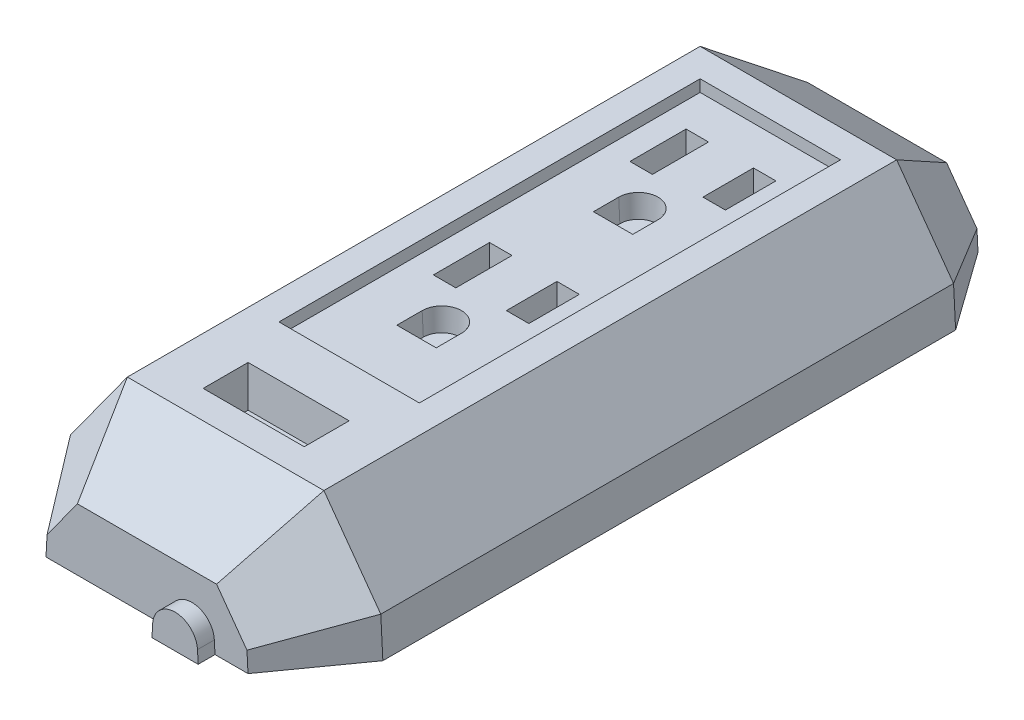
ISO-10303-21;
HEADER;
FILE_DESCRIPTION(('STEP AP214'),'2;1');
FILE_NAME('part.step','',(''),(''),'','','');
FILE_SCHEMA(('AUTOMOTIVE_DESIGN { 1 0 10303 214 1 1 1 1 }'));
ENDSEC;
DATA;
#1=APPLICATION_CONTEXT('core data for automotive mechanical design processes');
#2=APPLICATION_PROTOCOL_DEFINITION('international standard','automotive_design',2000,#1);
#3=PRODUCT_CONTEXT('',#1,'mechanical');
#4=PRODUCT('Part','Part','',(#3));
#5=PRODUCT_RELATED_PRODUCT_CATEGORY('part','',(#4));
#6=PRODUCT_DEFINITION_FORMATION('','',#4);
#7=PRODUCT_DEFINITION_CONTEXT('part definition',#1,'design');
#8=PRODUCT_DEFINITION('design','',#6,#7);
#9=PRODUCT_DEFINITION_SHAPE('','',#8);
#10=(LENGTH_UNIT() NAMED_UNIT(*) SI_UNIT(.MILLI.,.METRE.));
#11=(NAMED_UNIT(*) PLANE_ANGLE_UNIT() SI_UNIT($,.RADIAN.));
#12=(NAMED_UNIT(*) SI_UNIT($,.STERADIAN.) SOLID_ANGLE_UNIT());
#13=UNCERTAINTY_MEASURE_WITH_UNIT(LENGTH_MEASURE(1.E-05),#10,'distance_accuracy_value','');
#14=(GEOMETRIC_REPRESENTATION_CONTEXT(3) GLOBAL_UNCERTAINTY_ASSIGNED_CONTEXT((#13)) GLOBAL_UNIT_ASSIGNED_CONTEXT((#10,
#11,#12)) REPRESENTATION_CONTEXT('',''));
#15=CARTESIAN_POINT('',(0.,0.,0.));
#16=DIRECTION('',(0.,0.,1.));
#17=DIRECTION('',(1.,0.,0.));
#18=AXIS2_PLACEMENT_3D('',#15,#16,#17);
#19=CARTESIAN_POINT('',(27.6331455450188,7.,130.));
#20=DIRECTION('',(-0.998629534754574,-0.0523359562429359,0.));
#21=DIRECTION('',(0.052335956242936,-0.998629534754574,0.));
#22=AXIS2_PLACEMENT_3D('',#19,#20,#21);
#23=PLANE('',#22);
#24=DIRECTION('',(0.,0.,-1.));
#25=VECTOR('',#24,1.);
#26=CARTESIAN_POINT('',(28.,0.,130.));
#27=LINE('',#26,#25);
#28=CARTESIAN_POINT('',(28.,0.,116.));
#29=VERTEX_POINT('',#28);
#30=CARTESIAN_POINT('',(28.,0.,14.0000000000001));
#31=VERTEX_POINT('',#30);
#32=EDGE_CURVE('E668',#29,#31,#27,.T.);
#33=ORIENTED_EDGE('',*,*,#32,.T.);
#34=DIRECTION('',(-0.052335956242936,0.998629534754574,0.));
#35=VECTOR('',#34,1.);
#36=CARTESIAN_POINT('',(27.6331455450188,7.,14.0000000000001));
#37=LINE('',#36,#35);
#38=CARTESIAN_POINT('',(27.6331455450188,7.,14.0000000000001));
#39=VERTEX_POINT('',#38);
#40=EDGE_CURVE('E11',#31,#39,#37,.T.);
#41=ORIENTED_EDGE('',*,*,#40,.T.);
#42=DIRECTION('',(0.,0.,-1.));
#43=VECTOR('',#42,1.);
#44=CARTESIAN_POINT('',(27.6331455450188,7.,130.));
#45=LINE('',#44,#43);
#46=CARTESIAN_POINT('',(27.6331455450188,7.,116.));
#47=VERTEX_POINT('',#46);
#48=EDGE_CURVE('E692',#47,#39,#45,.T.);
#49=ORIENTED_EDGE('',*,*,#48,.F.);
#50=DIRECTION('',(0.052335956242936,-0.998629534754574,0.));
#51=VECTOR('',#50,1.);
#52=CARTESIAN_POINT('',(28.,0.,116.));
#53=LINE('',#52,#51);
#54=EDGE_CURVE('E710',#47,#29,#53,.T.);
#55=ORIENTED_EDGE('',*,*,#54,.T.);
#56=EDGE_LOOP('',(#33,#41,#49,#55));
#57=FACE_BOUND('',#56,.T.);
#58=ADVANCED_FACE('F41',(#57),#23,.F.);
#59=CARTESIAN_POINT('',(17.5,21.,130.));
#60=DIRECTION('',(-0.810073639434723,-0.586328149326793,0.));
#61=DIRECTION('',(0.586328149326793,-0.810073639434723,0.));
#62=AXIS2_PLACEMENT_3D('',#59,#60,#61);
#63=PLANE('',#62);
#64=ORIENTED_EDGE('',*,*,#48,.T.);
#65=DIRECTION('',(-0.586328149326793,0.810073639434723,0.));
#66=VECTOR('',#65,1.);
#67=CARTESIAN_POINT('',(17.5,21.,14.0000000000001));
#68=LINE('',#67,#66);
#69=CARTESIAN_POINT('',(17.5,21.,14.0000000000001));
#70=VERTEX_POINT('',#69);
#71=EDGE_CURVE('E49',#39,#70,#68,.T.);
#72=ORIENTED_EDGE('',*,*,#71,.T.);
#73=DIRECTION('',(0.,0.,-1.));
#74=VECTOR('',#73,1.);
#75=CARTESIAN_POINT('',(17.5,21.,130.));
#76=LINE('',#75,#74);
#77=CARTESIAN_POINT('',(17.5,21.,116.));
#78=VERTEX_POINT('',#77);
#79=EDGE_CURVE('E691',#78,#70,#76,.T.);
#80=ORIENTED_EDGE('',*,*,#79,.F.);
#81=DIRECTION('',(0.586328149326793,-0.810073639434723,0.));
#82=VECTOR('',#81,1.);
#83=CARTESIAN_POINT('',(27.6331455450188,7.,116.));
#84=LINE('',#83,#82);
#85=EDGE_CURVE('E715',#78,#47,#84,.T.);
#86=ORIENTED_EDGE('',*,*,#85,.T.);
#87=EDGE_LOOP('',(#64,#72,#80,#86));
#88=FACE_BOUND('',#87,.T.);
#89=ADVANCED_FACE('F806',(#88),#63,.F.);
#90=CARTESIAN_POINT('',(-17.5,21.,130.));
#91=DIRECTION('',(0.,-1.,0.));
#92=DIRECTION('',(0.,0.,-1.));
#93=AXIS2_PLACEMENT_3D('',#90,#91,#92);
#94=PLANE('',#93);
#95=DIRECTION('',(1.,0.,0.));
#96=VECTOR('',#95,1.);
#97=CARTESIAN_POINT('',(-9.,20.9999999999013,111.));
#98=LINE('',#97,#96);
#99=CARTESIAN_POINT('',(-9.,21.,111.000000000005));
#100=VERTEX_POINT('',#99);
#101=CARTESIAN_POINT('',(9.,20.9999999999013,111.));
#102=VERTEX_POINT('',#101);
#103=EDGE_CURVE('E365',#100,#102,#98,.T.);
#104=ORIENTED_EDGE('',*,*,#103,.F.);
#105=DIRECTION('',(0.,0.,1.));
#106=VECTOR('',#105,1.);
#107=CARTESIAN_POINT('',(-9.,20.9999999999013,111.));
#108=LINE('',#107,#106);
#109=CARTESIAN_POINT('',(-9.,20.9999999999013,103.));
#110=VERTEX_POINT('',#109);
#111=EDGE_CURVE('E59',#110,#100,#108,.T.);
#112=ORIENTED_EDGE('',*,*,#111,.F.);
#113=DIRECTION('',(-1.,0.,0.));
#114=VECTOR('',#113,1.);
#115=CARTESIAN_POINT('',(-9.,20.9999999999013,103.));
#116=LINE('',#115,#114);
#117=CARTESIAN_POINT('',(9.,20.9999999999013,103.));
#118=VERTEX_POINT('',#117);
#119=EDGE_CURVE('E367',#118,#110,#116,.T.);
#120=ORIENTED_EDGE('',*,*,#119,.F.);
#121=DIRECTION('',(0.,0.,-1.));
#122=VECTOR('',#121,1.);
#123=CARTESIAN_POINT('',(9.,20.9999999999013,111.));
#124=LINE('',#123,#122);
#125=EDGE_CURVE('E351',#102,#118,#124,.T.);
#126=ORIENTED_EDGE('',*,*,#125,.F.);
#127=EDGE_LOOP('',(#104,#112,#120,#126));
#128=FACE_BOUND('',#127,.T.);
#129=DIRECTION('',(-1.,0.,0.));
#130=VECTOR('',#129,1.);
#131=CARTESIAN_POINT('',(12.5,20.9999999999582,19.0000000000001));
#132=LINE('',#131,#130);
#133=CARTESIAN_POINT('',(12.5,21.,18.9999999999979));
#134=VERTEX_POINT('',#133);
#135=CARTESIAN_POINT('',(-12.5,20.9999999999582,19.0000000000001));
#136=VERTEX_POINT('',#135);
#137=EDGE_CURVE('E576',#134,#136,#132,.T.);
#138=ORIENTED_EDGE('',*,*,#137,.F.);
#139=DIRECTION('',(0.,0.,-1.));
#140=VECTOR('',#139,1.);
#141=CARTESIAN_POINT('',(12.5,20.9999999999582,19.0000000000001));
#142=LINE('',#141,#140);
#143=CARTESIAN_POINT('',(12.5,20.9999999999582,94.0000000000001));
#144=VERTEX_POINT('',#143);
#145=EDGE_CURVE('E559',#144,#134,#142,.T.);
#146=ORIENTED_EDGE('',*,*,#145,.F.);
#147=DIRECTION('',(1.,0.,0.));
#148=VECTOR('',#147,1.);
#149=CARTESIAN_POINT('',(12.5,20.9999999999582,94.0000000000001));
#150=LINE('',#149,#148);
#151=CARTESIAN_POINT('',(-12.5,20.9999999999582,94.0000000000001));
#152=VERTEX_POINT('',#151);
#153=EDGE_CURVE('E583',#152,#144,#150,.T.);
#154=ORIENTED_EDGE('',*,*,#153,.F.);
#155=DIRECTION('',(0.,0.,1.));
#156=VECTOR('',#155,1.);
#157=CARTESIAN_POINT('',(-12.5,20.9999999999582,19.0000000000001));
#158=LINE('',#157,#156);
#159=EDGE_CURVE('E585',#136,#152,#158,.T.);
#160=ORIENTED_EDGE('',*,*,#159,.F.);
#161=EDGE_LOOP('',(#138,#146,#154,#160));
#162=FACE_BOUND('',#161,.T.);
#163=ORIENTED_EDGE('',*,*,#79,.T.);
#164=DIRECTION('',(-1.,0.,0.));
#165=VECTOR('',#164,1.);
#166=CARTESIAN_POINT('',(-17.5,21.,14.0000000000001));
#167=LINE('',#166,#165);
#168=CARTESIAN_POINT('',(-17.5,21.,14.0000000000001));
#169=VERTEX_POINT('',#168);
#170=EDGE_CURVE('E747',#70,#169,#167,.T.);
#171=ORIENTED_EDGE('',*,*,#170,.T.);
#172=DIRECTION('',(0.,0.,-1.));
#173=VECTOR('',#172,1.);
#174=CARTESIAN_POINT('',(-17.5,21.,130.));
#175=LINE('',#174,#173);
#176=CARTESIAN_POINT('',(-17.5,21.,116.));
#177=VERTEX_POINT('',#176);
#178=EDGE_CURVE('E686',#177,#169,#175,.T.);
#179=ORIENTED_EDGE('',*,*,#178,.F.);
#180=DIRECTION('',(1.,0.,0.));
#181=VECTOR('',#180,1.);
#182=CARTESIAN_POINT('',(17.5,21.,116.));
#183=LINE('',#182,#181);
#184=EDGE_CURVE('E711',#177,#78,#183,.T.);
#185=ORIENTED_EDGE('',*,*,#184,.T.);
#186=EDGE_LOOP('',(#163,#171,#179,#185));
#187=FACE_BOUND('',#186,.T.);
#188=ADVANCED_FACE('F366',(#128,#162,#187),#94,.F.);
#189=CARTESIAN_POINT('',(-27.6331455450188,7.,130.));
#190=DIRECTION('',(0.810073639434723,-0.586328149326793,0.));
#191=DIRECTION('',(0.586328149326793,0.810073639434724,0.));
#192=AXIS2_PLACEMENT_3D('',#189,#190,#191);
#193=PLANE('',#192);
#194=ORIENTED_EDGE('',*,*,#178,.T.);
#195=DIRECTION('',(-0.586328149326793,-0.810073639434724,0.));
#196=VECTOR('',#195,1.);
#197=CARTESIAN_POINT('',(-27.6331455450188,7.,14.0000000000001));
#198=LINE('',#197,#196);
#199=CARTESIAN_POINT('',(-27.6331455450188,7.,14.0000000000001));
#200=VERTEX_POINT('',#199);
#201=EDGE_CURVE('E744',#169,#200,#198,.T.);
#202=ORIENTED_EDGE('',*,*,#201,.T.);
#203=DIRECTION('',(0.,0.,-1.));
#204=VECTOR('',#203,1.);
#205=CARTESIAN_POINT('',(-27.6331455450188,7.,130.));
#206=LINE('',#205,#204);
#207=CARTESIAN_POINT('',(-27.6331455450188,7.,116.));
#208=VERTEX_POINT('',#207);
#209=EDGE_CURVE('E684',#208,#200,#206,.T.);
#210=ORIENTED_EDGE('',*,*,#209,.F.);
#211=DIRECTION('',(0.586328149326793,0.810073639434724,0.));
#212=VECTOR('',#211,1.);
#213=CARTESIAN_POINT('',(-17.5,21.,116.));
#214=LINE('',#213,#212);
#215=EDGE_CURVE('E718',#208,#177,#214,.T.);
#216=ORIENTED_EDGE('',*,*,#215,.T.);
#217=EDGE_LOOP('',(#194,#202,#210,#216));
#218=FACE_BOUND('',#217,.T.);
#219=ADVANCED_FACE('F784',(#218),#193,.F.);
#220=CARTESIAN_POINT('',(-27.6331455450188,7.,130.));
#221=DIRECTION('',(0.998629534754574,-0.0523359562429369,0.));
#222=DIRECTION('',(0.0523359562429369,0.998629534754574,0.));
#223=AXIS2_PLACEMENT_3D('',#220,#221,#222);
#224=PLANE('',#223);
#225=ORIENTED_EDGE('',*,*,#209,.T.);
#226=DIRECTION('',(-0.0523359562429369,-0.998629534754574,0.));
#227=VECTOR('',#226,1.);
#228=CARTESIAN_POINT('',(-27.6331455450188,7.,14.0000000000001));
#229=LINE('',#228,#227);
#230=CARTESIAN_POINT('',(-28.,0.,14.0000000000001));
#231=VERTEX_POINT('',#230);
#232=EDGE_CURVE('E719',#200,#231,#229,.T.);
#233=ORIENTED_EDGE('',*,*,#232,.T.);
#234=DIRECTION('',(0.,0.,-1.));
#235=VECTOR('',#234,1.);
#236=CARTESIAN_POINT('',(-28.,0.,130.));
#237=LINE('',#236,#235);
#238=CARTESIAN_POINT('',(-28.,0.,116.));
#239=VERTEX_POINT('',#238);
#240=EDGE_CURVE('E681',#239,#231,#237,.T.);
#241=ORIENTED_EDGE('',*,*,#240,.F.);
#242=DIRECTION('',(0.0523359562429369,0.998629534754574,0.));
#243=VECTOR('',#242,1.);
#244=CARTESIAN_POINT('',(-27.6331455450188,7.,116.));
#245=LINE('',#244,#243);
#246=EDGE_CURVE('E716',#239,#208,#245,.T.);
#247=ORIENTED_EDGE('',*,*,#246,.T.);
#248=EDGE_LOOP('',(#225,#233,#241,#247));
#249=FACE_BOUND('',#248,.T.);
#250=ADVANCED_FACE('F789',(#249),#224,.F.);
#251=CARTESIAN_POINT('',(-28.,0.,130.));
#252=DIRECTION('',(0.,1.,0.));
#253=DIRECTION('',(0.,0.,1.));
#254=AXIS2_PLACEMENT_3D('',#251,#252,#253);
#255=PLANE('',#254);
#256=ORIENTED_EDGE('',*,*,#240,.T.);
#257=DIRECTION('',(-0.581766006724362,0.,0.813356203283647));
#258=VECTOR('',#257,1.);
#259=CARTESIAN_POINT('',(-27.8758374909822,0.,13.8264107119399));
#260=LINE('',#259,#258);
#261=CARTESIAN_POINT('',(-17.9862765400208,0.,0.));
#262=VERTEX_POINT('',#261);
#263=EDGE_CURVE('E734',#231,#262,#260,.F.);
#264=ORIENTED_EDGE('',*,*,#263,.T.);
#265=DIRECTION('',(1.,0.,0.));
#266=VECTOR('',#265,1.);
#267=CARTESIAN_POINT('',(-28.,0.,0.));
#268=LINE('',#267,#266);
#269=CARTESIAN_POINT('',(17.9862765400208,0.,0.));
#270=VERTEX_POINT('',#269);
#271=EDGE_CURVE('E666',#262,#270,#268,.T.);
#272=ORIENTED_EDGE('',*,*,#271,.T.);
#273=DIRECTION('',(-0.581766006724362,0.,-0.813356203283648));
#274=VECTOR('',#273,1.);
#275=CARTESIAN_POINT('',(27.8758374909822,0.,13.8264107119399));
#276=LINE('',#275,#274);
#277=EDGE_CURVE('E732',#270,#31,#276,.F.);
#278=ORIENTED_EDGE('',*,*,#277,.T.);
#279=ORIENTED_EDGE('',*,*,#32,.F.);
#280=DIRECTION('',(-0.581766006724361,0.,0.813356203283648));
#281=VECTOR('',#280,1.);
#282=CARTESIAN_POINT('',(17.9955596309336,0.,129.987021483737));
#283=LINE('',#282,#281);
#284=CARTESIAN_POINT('',(17.9862765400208,0.,130.));
#285=VERTEX_POINT('',#284);
#286=EDGE_CURVE('E667',#29,#285,#283,.T.);
#287=ORIENTED_EDGE('',*,*,#286,.T.);
#288=DIRECTION('',(1.,0.,0.));
#289=VECTOR('',#288,1.);
#290=CARTESIAN_POINT('',(-28.,0.,130.));
#291=LINE('',#290,#289);
#292=CARTESIAN_POINT('',(12.1103049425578,0.,130.));
#293=VERTEX_POINT('',#292);
#294=EDGE_CURVE('E631',#293,#285,#291,.T.);
#295=ORIENTED_EDGE('',*,*,#294,.F.);
#296=DIRECTION('',(0.,0.,-1.));
#297=VECTOR('',#296,1.);
#298=CARTESIAN_POINT('',(12.1103049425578,0.,132.999999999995));
#299=LINE('',#298,#297);
#300=CARTESIAN_POINT('',(12.1103049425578,0.,132.999999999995));
#301=VERTEX_POINT('',#300);
#302=EDGE_CURVE('E637',#301,#293,#299,.T.);
#303=ORIENTED_EDGE('',*,*,#302,.F.);
#304=DIRECTION('',(1.,0.,0.));
#305=VECTOR('',#304,1.);
#306=CARTESIAN_POINT('',(3.88969505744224,0.,132.999999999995));
#307=LINE('',#306,#305);
#308=CARTESIAN_POINT('',(3.88969505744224,0.,132.999999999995));
#309=VERTEX_POINT('',#308);
#310=EDGE_CURVE('E618',#309,#301,#307,.T.);
#311=ORIENTED_EDGE('',*,*,#310,.F.);
#312=DIRECTION('',(0.,0.,-1.));
#313=VECTOR('',#312,1.);
#314=CARTESIAN_POINT('',(3.88969505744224,0.,132.999999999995));
#315=LINE('',#314,#313);
#316=CARTESIAN_POINT('',(3.88969505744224,0.,129.999999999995));
#317=VERTEX_POINT('',#316);
#318=EDGE_CURVE('E632',#309,#317,#315,.T.);
#319=ORIENTED_EDGE('',*,*,#318,.T.);
#320=CARTESIAN_POINT('',(-17.9862765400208,0.,130.));
#321=VERTEX_POINT('',#320);
#322=EDGE_CURVE('E669',#321,#317,#291,.T.);
#323=ORIENTED_EDGE('',*,*,#322,.F.);
#324=DIRECTION('',(-0.581766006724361,0.,-0.813356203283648));
#325=VECTOR('',#324,1.);
#326=CARTESIAN_POINT('',(-17.9436455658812,0.,130.05960156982));
#327=LINE('',#326,#325);
#328=EDGE_CURVE('E706',#321,#239,#327,.T.);
#329=ORIENTED_EDGE('',*,*,#328,.T.);
#330=EDGE_LOOP('',(#256,#264,#272,#278,#279,#287,#295,#303,#311,#319,#323,#329));
#331=FACE_BOUND('',#330,.T.);
#332=ADVANCED_FACE('F665',(#331),#255,.F.);
#333=CARTESIAN_POINT('',(28.,0.,130.));
#334=DIRECTION('',(0.,0.,1.));
#335=DIRECTION('',(1.,0.,0.));
#336=AXIS2_PLACEMENT_3D('',#333,#334,#335);
#337=PLANE('',#336);
#338=DIRECTION('',(-0.0523359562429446,0.998629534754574,0.));
#339=VECTOR('',#338,1.);
#340=CARTESIAN_POINT('',(12.1103049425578,0.,129.999999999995));
#341=LINE('',#340,#339);
#342=CARTESIAN_POINT('',(11.9945181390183,2.20934382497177,129.999999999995));
#343=VERTEX_POINT('',#342);
#344=EDGE_CURVE('E613',#293,#343,#341,.T.);
#345=ORIENTED_EDGE('',*,*,#344,.F.);
#346=ORIENTED_EDGE('',*,*,#294,.T.);
#347=DIRECTION('',(-0.0523359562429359,0.998629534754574,0.));
#348=VECTOR('',#347,1.);
#349=CARTESIAN_POINT('',(17.646850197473,6.47664043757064,130.));
#350=LINE('',#349,#348);
#351=CARTESIAN_POINT('',(17.8013641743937,3.52833812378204,130.));
#352=VERTEX_POINT('',#351);
#353=EDGE_CURVE('E704',#285,#352,#350,.T.);
#354=ORIENTED_EDGE('',*,*,#353,.T.);
#355=DIRECTION('',(-0.586328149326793,0.810073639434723,0.));
#356=VECTOR('',#355,1.);
#357=CARTESIAN_POINT('',(9.39926360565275,15.1367185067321,130.));
#358=LINE('',#357,#356);
#359=CARTESIAN_POINT('',(12.3934043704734,11.,130.));
#360=VERTEX_POINT('',#359);
#361=EDGE_CURVE('E702',#352,#360,#358,.T.);
#362=ORIENTED_EDGE('',*,*,#361,.T.);
#363=DIRECTION('',(-1.,0.,0.));
#364=VECTOR('',#363,1.);
#365=CARTESIAN_POINT('',(-17.5,11.,130.));
#366=LINE('',#365,#364);
#367=CARTESIAN_POINT('',(-12.3934043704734,11.,130.));
#368=VERTEX_POINT('',#367);
#369=EDGE_CURVE('E701',#360,#368,#366,.T.);
#370=ORIENTED_EDGE('',*,*,#369,.T.);
#371=DIRECTION('',(-0.586328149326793,-0.810073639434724,0.));
#372=VECTOR('',#371,1.);
#373=CARTESIAN_POINT('',(-19.5324091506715,1.13671850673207,130.));
#374=LINE('',#373,#372);
#375=CARTESIAN_POINT('',(-17.8013641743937,3.52833812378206,130.));
#376=VERTEX_POINT('',#375);
#377=EDGE_CURVE('E697',#368,#376,#374,.T.);
#378=ORIENTED_EDGE('',*,*,#377,.T.);
#379=DIRECTION('',(-0.0523359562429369,-0.998629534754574,0.));
#380=VECTOR('',#379,1.);
#381=CARTESIAN_POINT('',(-18.0137046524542,-0.52335956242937,130.));
#382=LINE('',#381,#380);
#383=EDGE_CURVE('E700',#376,#321,#382,.T.);
#384=ORIENTED_EDGE('',*,*,#383,.T.);
#385=ORIENTED_EDGE('',*,*,#322,.T.);
#386=DIRECTION('',(-0.0523359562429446,-0.998629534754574,0.));
#387=VECTOR('',#386,1.);
#388=CARTESIAN_POINT('',(3.88969505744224,0.,129.999999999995));
#389=LINE('',#388,#387);
#390=CARTESIAN_POINT('',(4.00548186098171,2.20934382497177,129.999999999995));
#391=VERTEX_POINT('',#390);
#392=EDGE_CURVE('E621',#391,#317,#389,.T.);
#393=ORIENTED_EDGE('',*,*,#392,.F.);
#394=CARTESIAN_POINT('',(8.,2.,129.999999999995));
#395=DIRECTION('',(0.,0.,1.));
#396=DIRECTION('',(1.,0.,0.));
#397=AXIS2_PLACEMENT_3D('',#394,#395,#396);
#398=CIRCLE('',#397,3.99999999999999);
#399=EDGE_CURVE('E592',#343,#391,#398,.T.);
#400=ORIENTED_EDGE('',*,*,#399,.F.);
#401=EDGE_LOOP('',(#345,#346,#354,#362,#370,#378,#384,#385,#393,#400));
#402=FACE_BOUND('',#401,.T.);
#403=ADVANCED_FACE('F660',(#402),#337,.T.);
#404=CARTESIAN_POINT('',(28.,0.,0.));
#405=DIRECTION('',(0.,0.,1.));
#406=DIRECTION('',(1.,0.,0.));
#407=AXIS2_PLACEMENT_3D('',#404,#405,#406);
#408=PLANE('',#407);
#409=ORIENTED_EDGE('',*,*,#271,.F.);
#410=DIRECTION('',(0.0523359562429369,0.998629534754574,0.));
#411=VECTOR('',#410,1.);
#412=CARTESIAN_POINT('',(-17.8603177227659,2.40343740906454,0.));
#413=LINE('',#412,#411);
#414=CARTESIAN_POINT('',(-17.8013641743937,3.52833812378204,0.));
#415=VERTEX_POINT('',#414);
#416=EDGE_CURVE('E742',#262,#415,#413,.T.);
#417=ORIENTED_EDGE('',*,*,#416,.T.);
#418=DIRECTION('',(0.586328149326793,0.810073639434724,0.));
#419=VECTOR('',#418,1.);
#420=CARTESIAN_POINT('',(-3.73159034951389,22.9672016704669,0.));
#421=LINE('',#420,#419);
#422=CARTESIAN_POINT('',(-12.3934043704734,11.,0.));
#423=VERTEX_POINT('',#422);
#424=EDGE_CURVE('E741',#415,#423,#421,.T.);
#425=ORIENTED_EDGE('',*,*,#424,.T.);
#426=DIRECTION('',(1.,0.,0.));
#427=VECTOR('',#426,1.);
#428=CARTESIAN_POINT('',(28.,11.,0.));
#429=LINE('',#428,#427);
#430=CARTESIAN_POINT('',(12.3934043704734,11.,0.));
#431=VERTEX_POINT('',#430);
#432=EDGE_CURVE('E736',#423,#431,#429,.T.);
#433=ORIENTED_EDGE('',*,*,#432,.T.);
#434=DIRECTION('',(0.586328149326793,-0.810073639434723,0.));
#435=VECTOR('',#434,1.);
#436=CARTESIAN_POINT('',(22.9833094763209,-3.63106108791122,0.));
#437=LINE('',#436,#435);
#438=CARTESIAN_POINT('',(17.8013641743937,3.52833812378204,0.));
#439=VERTEX_POINT('',#438);
#440=EDGE_CURVE('E739',#431,#439,#437,.T.);
#441=ORIENTED_EDGE('',*,*,#440,.T.);
#442=DIRECTION('',(0.0523359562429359,-0.998629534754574,0.));
#443=VECTOR('',#442,1.);
#444=CARTESIAN_POINT('',(18.0137046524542,-0.523359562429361,0.));
#445=LINE('',#444,#443);
#446=EDGE_CURVE('E733',#439,#270,#445,.T.);
#447=ORIENTED_EDGE('',*,*,#446,.T.);
#448=EDGE_LOOP('',(#409,#417,#425,#433,#441,#447));
#449=FACE_BOUND('',#448,.T.);
#450=ADVANCED_FACE('F769',(#449),#408,.F.);
#451=CARTESIAN_POINT('',(-17.8603177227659,2.40343740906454,130.));
#452=DIRECTION('',(-0.812618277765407,0.0425875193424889,0.581238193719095));
#453=DIRECTION('',(0.581766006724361,0.,0.813356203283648));
#454=AXIS2_PLACEMENT_3D('',#451,#452,#453);
#455=PLANE('',#454);
#456=ORIENTED_EDGE('',*,*,#328,.F.);
#457=ORIENTED_EDGE('',*,*,#383,.F.);
#458=DIRECTION('',(-0.563228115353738,0.198879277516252,-0.802010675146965));
#459=VECTOR('',#458,1.);
#460=CARTESIAN_POINT('',(-17.6940606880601,3.49044860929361,130.15279518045));
#461=LINE('',#460,#459);
#462=EDGE_CURVE('E674',#208,#376,#461,.F.);
#463=ORIENTED_EDGE('',*,*,#462,.F.);
#464=ORIENTED_EDGE('',*,*,#246,.F.);
#465=EDGE_LOOP('',(#456,#457,#463,#464));
#466=FACE_BOUND('',#465,.T.);
#467=ADVANCED_FACE('F794',(#466),#455,.T.);
#468=CARTESIAN_POINT('',(-3.73159034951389,22.9672016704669,130.));
#469=DIRECTION('',(-0.659184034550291,0.477114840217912,0.581238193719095));
#470=DIRECTION('',(0.661369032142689,0.,0.750060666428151));
#471=AXIS2_PLACEMENT_3D('',#468,#469,#470);
#472=PLANE('',#471);
#473=ORIENTED_EDGE('',*,*,#462,.T.);
#474=ORIENTED_EDGE('',*,*,#377,.F.);
#475=DIRECTION('',(-0.284545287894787,0.557211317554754,-0.780095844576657));
#476=VECTOR('',#475,1.);
#477=CARTESIAN_POINT('',(-13.5895137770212,13.3422833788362,126.720803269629));
#478=LINE('',#477,#476);
#479=EDGE_CURVE('E680',#177,#368,#478,.F.);
#480=ORIENTED_EDGE('',*,*,#479,.F.);
#481=ORIENTED_EDGE('',*,*,#215,.F.);
#482=EDGE_LOOP('',(#473,#474,#480,#481));
#483=FACE_BOUND('',#482,.T.);
#484=ADVANCED_FACE('F798',(#483),#472,.T.);
#485=CARTESIAN_POINT('',(28.,11.,130.));
#486=DIRECTION('',(0.,0.813733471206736,0.581238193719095));
#487=DIRECTION('',(0.,-0.581238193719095,0.813733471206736));
#488=AXIS2_PLACEMENT_3D('',#485,#486,#487);
#489=PLANE('',#488);
#490=ORIENTED_EDGE('',*,*,#479,.T.);
#491=ORIENTED_EDGE('',*,*,#369,.F.);
#492=DIRECTION('',(0.284545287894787,0.557211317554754,-0.780095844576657));
#493=VECTOR('',#492,1.);
#494=CARTESIAN_POINT('',(13.657008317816,13.4744546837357,126.53576344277));
#495=LINE('',#494,#493);
#496=EDGE_CURVE('E723',#78,#360,#495,.F.);
#497=ORIENTED_EDGE('',*,*,#496,.F.);
#498=ORIENTED_EDGE('',*,*,#184,.F.);
#499=EDGE_LOOP('',(#490,#491,#497,#498));
#500=FACE_BOUND('',#499,.T.);
#501=ADVANCED_FACE('F813',(#500),#489,.T.);
#502=CARTESIAN_POINT('',(22.9833094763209,-3.63106108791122,130.));
#503=DIRECTION('',(0.659184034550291,0.477114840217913,0.581238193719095));
#504=DIRECTION('',(0.66136903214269,0.,-0.750060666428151));
#505=AXIS2_PLACEMENT_3D('',#502,#503,#504);
#506=PLANE('',#505);
#507=ORIENTED_EDGE('',*,*,#496,.T.);
#508=ORIENTED_EDGE('',*,*,#361,.F.);
#509=DIRECTION('',(0.563228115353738,0.198879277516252,-0.802010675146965));
#510=VECTOR('',#509,1.);
#511=CARTESIAN_POINT('',(18.6432556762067,3.82561514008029,128.801185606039));
#512=LINE('',#511,#510);
#513=EDGE_CURVE('E722',#47,#352,#512,.F.);
#514=ORIENTED_EDGE('',*,*,#513,.F.);
#515=ORIENTED_EDGE('',*,*,#85,.F.);
#516=EDGE_LOOP('',(#507,#508,#514,#515));
#517=FACE_BOUND('',#516,.T.);
#518=ADVANCED_FACE('F814',(#517),#506,.T.);
#519=CARTESIAN_POINT('',(18.0137046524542,-0.52335956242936,130.));
#520=DIRECTION('',(0.812618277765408,0.0425875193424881,0.581238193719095));
#521=DIRECTION('',(0.581766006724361,0.,-0.813356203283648));
#522=AXIS2_PLACEMENT_3D('',#519,#520,#521);
#523=PLANE('',#522);
#524=ORIENTED_EDGE('',*,*,#286,.F.);
#525=ORIENTED_EDGE('',*,*,#54,.F.);
#526=ORIENTED_EDGE('',*,*,#513,.T.);
#527=ORIENTED_EDGE('',*,*,#353,.F.);
#528=EDGE_LOOP('',(#524,#525,#526,#527));
#529=FACE_BOUND('',#528,.T.);
#530=ADVANCED_FACE('F816',(#529),#523,.T.);
#531=CARTESIAN_POINT('',(27.6331455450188,7.,14.0000000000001));
#532=DIRECTION('',(-0.812618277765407,-0.0425875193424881,0.581238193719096));
#533=DIRECTION('',(0.581766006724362,0.,0.813356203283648));
#534=AXIS2_PLACEMENT_3D('',#531,#532,#533);
#535=PLANE('',#534);
#536=ORIENTED_EDGE('',*,*,#277,.F.);
#537=ORIENTED_EDGE('',*,*,#446,.F.);
#538=DIRECTION('',(0.563228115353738,0.198879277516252,0.802010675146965));
#539=VECTOR('',#538,1.);
#540=CARTESIAN_POINT('',(27.6331455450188,7.,14.0000000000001));
#541=LINE('',#540,#539);
#542=EDGE_CURVE('E724',#39,#439,#541,.F.);
#543=ORIENTED_EDGE('',*,*,#542,.F.);
#544=ORIENTED_EDGE('',*,*,#40,.F.);
#545=EDGE_LOOP('',(#536,#537,#543,#544));
#546=FACE_BOUND('',#545,.T.);
#547=ADVANCED_FACE('F43',(#546),#535,.F.);
#548=CARTESIAN_POINT('',(17.5,21.,14.0000000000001));
#549=DIRECTION('',(-0.659184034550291,-0.477114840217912,0.581238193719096));
#550=DIRECTION('',(0.66136903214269,0.,0.750060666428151));
#551=AXIS2_PLACEMENT_3D('',#548,#549,#550);
#552=PLANE('',#551);
#553=ORIENTED_EDGE('',*,*,#542,.T.);
#554=ORIENTED_EDGE('',*,*,#440,.F.);
#555=DIRECTION('',(0.284545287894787,0.557211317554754,0.780095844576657));
#556=VECTOR('',#555,1.);
#557=CARTESIAN_POINT('',(17.5,21.,14.0000000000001));
#558=LINE('',#557,#556);
#559=EDGE_CURVE('E756',#70,#431,#558,.F.);
#560=ORIENTED_EDGE('',*,*,#559,.F.);
#561=ORIENTED_EDGE('',*,*,#71,.F.);
#562=EDGE_LOOP('',(#553,#554,#560,#561));
#563=FACE_BOUND('',#562,.T.);
#564=ADVANCED_FACE('F762',(#563),#552,.F.);
#565=CARTESIAN_POINT('',(-17.5,21.,14.0000000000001));
#566=DIRECTION('',(0.,-0.813733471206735,0.581238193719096));
#567=DIRECTION('',(0.,-0.581238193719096,-0.813733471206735));
#568=AXIS2_PLACEMENT_3D('',#565,#566,#567);
#569=PLANE('',#568);
#570=ORIENTED_EDGE('',*,*,#559,.T.);
#571=ORIENTED_EDGE('',*,*,#432,.F.);
#572=DIRECTION('',(-0.284545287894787,0.557211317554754,0.780095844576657));
#573=VECTOR('',#572,1.);
#574=CARTESIAN_POINT('',(-17.5,21.,14.0000000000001));
#575=LINE('',#574,#573);
#576=EDGE_CURVE('E751',#169,#423,#575,.F.);
#577=ORIENTED_EDGE('',*,*,#576,.F.);
#578=ORIENTED_EDGE('',*,*,#170,.F.);
#579=EDGE_LOOP('',(#570,#571,#577,#578));
#580=FACE_BOUND('',#579,.T.);
#581=ADVANCED_FACE('F777',(#580),#569,.F.);
#582=CARTESIAN_POINT('',(-27.6331455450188,7.,14.0000000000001));
#583=DIRECTION('',(0.659184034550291,-0.477114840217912,0.581238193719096));
#584=DIRECTION('',(0.66136903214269,0.,-0.750060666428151));
#585=AXIS2_PLACEMENT_3D('',#582,#583,#584);
#586=PLANE('',#585);
#587=ORIENTED_EDGE('',*,*,#576,.T.);
#588=ORIENTED_EDGE('',*,*,#424,.F.);
#589=DIRECTION('',(-0.563228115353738,0.198879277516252,0.802010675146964));
#590=VECTOR('',#589,1.);
#591=CARTESIAN_POINT('',(-27.6331455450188,7.,14.0000000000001));
#592=LINE('',#591,#590);
#593=EDGE_CURVE('E749',#200,#415,#592,.F.);
#594=ORIENTED_EDGE('',*,*,#593,.F.);
#595=ORIENTED_EDGE('',*,*,#201,.F.);
#596=EDGE_LOOP('',(#587,#588,#594,#595));
#597=FACE_BOUND('',#596,.T.);
#598=ADVANCED_FACE('F778',(#597),#586,.F.);
#599=CARTESIAN_POINT('',(-27.6331455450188,7.,14.0000000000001));
#600=DIRECTION('',(0.812618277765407,-0.0425875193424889,0.581238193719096));
#601=DIRECTION('',(0.581766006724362,0.,-0.813356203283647));
#602=AXIS2_PLACEMENT_3D('',#599,#600,#601);
#603=PLANE('',#602);
#604=ORIENTED_EDGE('',*,*,#593,.T.);
#605=ORIENTED_EDGE('',*,*,#416,.F.);
#606=ORIENTED_EDGE('',*,*,#263,.F.);
#607=ORIENTED_EDGE('',*,*,#232,.F.);
#608=EDGE_LOOP('',(#604,#605,#606,#607));
#609=FACE_BOUND('',#608,.T.);
#610=ADVANCED_FACE('F839',(#609),#603,.F.);
#611=CARTESIAN_POINT('',(8.,2.,132.999999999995));
#612=DIRECTION('',(0.,0.,-1.));
#613=DIRECTION('',(-1.,0.,0.));
#614=AXIS2_PLACEMENT_3D('',#611,#612,#613);
#615=CYLINDRICAL_SURFACE('',#614,3.99999999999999);
#616=ORIENTED_EDGE('',*,*,#399,.T.);
#617=DIRECTION('',(0.,0.,-1.));
#618=VECTOR('',#617,1.);
#619=CARTESIAN_POINT('',(4.00548186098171,2.20934382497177,132.999999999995));
#620=LINE('',#619,#618);
#621=CARTESIAN_POINT('',(4.00548186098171,2.20934382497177,132.999999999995));
#622=VERTEX_POINT('',#621);
#623=EDGE_CURVE('E640',#622,#391,#620,.T.);
#624=ORIENTED_EDGE('',*,*,#623,.F.);
#625=CARTESIAN_POINT('',(8.,2.,132.999999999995));
#626=DIRECTION('',(0.,0.,1.));
#627=DIRECTION('',(1.,0.,0.));
#628=AXIS2_PLACEMENT_3D('',#625,#626,#627);
#629=CIRCLE('',#628,3.99999999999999);
#630=CARTESIAN_POINT('',(11.9945181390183,2.20934382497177,132.999999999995));
#631=VERTEX_POINT('',#630);
#632=EDGE_CURVE('E608',#631,#622,#629,.T.);
#633=ORIENTED_EDGE('',*,*,#632,.F.);
#634=DIRECTION('',(0.,0.,-1.));
#635=VECTOR('',#634,1.);
#636=CARTESIAN_POINT('',(11.9945181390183,2.20934382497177,132.999999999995));
#637=LINE('',#636,#635);
#638=EDGE_CURVE('E619',#631,#343,#637,.T.);
#639=ORIENTED_EDGE('',*,*,#638,.T.);
#640=EDGE_LOOP('',(#616,#624,#633,#639));
#641=FACE_BOUND('',#640,.T.);
#642=ADVANCED_FACE('F655',(#641),#615,.T.);
#643=CARTESIAN_POINT('',(3.88969505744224,0.,132.999999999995));
#644=DIRECTION('',(0.998629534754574,-0.0523359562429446,0.));
#645=DIRECTION('',(0.0523359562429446,0.998629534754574,0.));
#646=AXIS2_PLACEMENT_3D('',#643,#644,#645);
#647=PLANE('',#646);
#648=ORIENTED_EDGE('',*,*,#392,.T.);
#649=ORIENTED_EDGE('',*,*,#318,.F.);
#650=DIRECTION('',(-0.0523359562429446,-0.998629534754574,0.));
#651=VECTOR('',#650,1.);
#652=CARTESIAN_POINT('',(3.88969505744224,0.,132.999999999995));
#653=LINE('',#652,#651);
#654=EDGE_CURVE('E612',#622,#309,#653,.T.);
#655=ORIENTED_EDGE('',*,*,#654,.F.);
#656=ORIENTED_EDGE('',*,*,#623,.T.);
#657=EDGE_LOOP('',(#648,#649,#655,#656));
#658=FACE_BOUND('',#657,.T.);
#659=ADVANCED_FACE('F1073',(#658),#647,.F.);
#660=CARTESIAN_POINT('',(12.1103049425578,0.,132.999999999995));
#661=DIRECTION('',(-0.998629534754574,-0.0523359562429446,0.));
#662=DIRECTION('',(0.0523359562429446,-0.998629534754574,0.));
#663=AXIS2_PLACEMENT_3D('',#660,#661,#662);
#664=PLANE('',#663);
#665=ORIENTED_EDGE('',*,*,#344,.T.);
#666=ORIENTED_EDGE('',*,*,#638,.F.);
#667=DIRECTION('',(-0.0523359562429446,0.998629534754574,0.));
#668=VECTOR('',#667,1.);
#669=CARTESIAN_POINT('',(12.1103049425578,0.,132.999999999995));
#670=LINE('',#669,#668);
#671=EDGE_CURVE('E616',#301,#631,#670,.T.);
#672=ORIENTED_EDGE('',*,*,#671,.F.);
#673=ORIENTED_EDGE('',*,*,#302,.T.);
#674=EDGE_LOOP('',(#665,#666,#672,#673));
#675=FACE_BOUND('',#674,.T.);
#676=ADVANCED_FACE('F652',(#675),#664,.F.);
#677=CARTESIAN_POINT('',(8.,2.,132.999999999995));
#678=DIRECTION('',(0.,0.,1.));
#679=DIRECTION('',(1.,0.,0.));
#680=AXIS2_PLACEMENT_3D('',#677,#678,#679);
#681=PLANE('',#680);
#682=ORIENTED_EDGE('',*,*,#632,.T.);
#683=ORIENTED_EDGE('',*,*,#654,.T.);
#684=ORIENTED_EDGE('',*,*,#310,.T.);
#685=ORIENTED_EDGE('',*,*,#671,.T.);
#686=EDGE_LOOP('',(#682,#683,#684,#685));
#687=FACE_BOUND('',#686,.T.);
#688=ADVANCED_FACE('F1054',(#687),#681,.T.);
#689=CARTESIAN_POINT('',(12.5,20.9999999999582,19.0000000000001));
#690=DIRECTION('',(0.998629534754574,-0.0523359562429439,0.));
#691=DIRECTION('',(0.0523359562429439,0.998629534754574,0.));
#692=AXIS2_PLACEMENT_3D('',#689,#690,#691);
#693=PLANE('',#692);
#694=ORIENTED_EDGE('',*,*,#145,.T.);
#695=DIRECTION('',(0.052264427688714,0.997264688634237,-0.052264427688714));
#696=VECTOR('',#695,1.);
#697=CARTESIAN_POINT('',(12.5,20.9999999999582,19.0000000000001));
#698=LINE('',#697,#696);
#699=CARTESIAN_POINT('',(12.3951844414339,18.9999999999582,19.1048155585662));
#700=VERTEX_POINT('',#699);
#701=EDGE_CURVE('E593',#700,#134,#698,.T.);
#702=ORIENTED_EDGE('',*,*,#701,.F.);
#703=DIRECTION('',(0.,0.,-1.));
#704=VECTOR('',#703,1.);
#705=CARTESIAN_POINT('',(12.3951844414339,18.9999999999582,19.0000000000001));
#706=LINE('',#705,#704);
#707=CARTESIAN_POINT('',(12.3951844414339,18.9999999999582,93.895184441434));
#708=VERTEX_POINT('',#707);
#709=EDGE_CURVE('E586',#708,#700,#706,.T.);
#710=ORIENTED_EDGE('',*,*,#709,.F.);
#711=DIRECTION('',(0.052264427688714,0.997264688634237,0.052264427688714));
#712=VECTOR('',#711,1.);
#713=CARTESIAN_POINT('',(12.5,20.9999999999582,94.0000000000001));
#714=LINE('',#713,#712);
#715=EDGE_CURVE('E587',#708,#144,#714,.T.);
#716=ORIENTED_EDGE('',*,*,#715,.T.);
#717=EDGE_LOOP('',(#694,#702,#710,#716));
#718=FACE_BOUND('',#717,.T.);
#719=ADVANCED_FACE('F1046',(#718),#693,.F.);
#720=CARTESIAN_POINT('',(12.5,20.9999999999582,94.0000000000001));
#721=DIRECTION('',(0.,-0.0523359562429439,0.998629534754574));
#722=DIRECTION('',(0.,-0.998629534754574,-0.0523359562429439));
#723=AXIS2_PLACEMENT_3D('',#720,#721,#722);
#724=PLANE('',#723);
#725=ORIENTED_EDGE('',*,*,#153,.T.);
#726=ORIENTED_EDGE('',*,*,#715,.F.);
#727=DIRECTION('',(1.,0.,0.));
#728=VECTOR('',#727,1.);
#729=CARTESIAN_POINT('',(12.5,18.9999999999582,93.895184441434));
#730=LINE('',#729,#728);
#731=CARTESIAN_POINT('',(-12.3951844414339,18.9999999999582,93.895184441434));
#732=VERTEX_POINT('',#731);
#733=EDGE_CURVE('E600',#732,#708,#730,.T.);
#734=ORIENTED_EDGE('',*,*,#733,.F.);
#735=DIRECTION('',(-0.052264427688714,0.997264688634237,0.052264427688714));
#736=VECTOR('',#735,1.);
#737=CARTESIAN_POINT('',(-12.2951322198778,17.0908898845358,93.7951322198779));
#738=LINE('',#737,#736);
#739=EDGE_CURVE('E595',#732,#152,#738,.T.);
#740=ORIENTED_EDGE('',*,*,#739,.T.);
#741=EDGE_LOOP('',(#725,#726,#734,#740));
#742=FACE_BOUND('',#741,.T.);
#743=ADVANCED_FACE('F1051',(#742),#724,.F.);
#744=CARTESIAN_POINT('',(-12.5,20.9999999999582,19.0000000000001));
#745=DIRECTION('',(-0.998629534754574,-0.0523359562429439,0.));
#746=DIRECTION('',(0.0523359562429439,-0.998629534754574,0.));
#747=AXIS2_PLACEMENT_3D('',#744,#745,#746);
#748=PLANE('',#747);
#749=ORIENTED_EDGE('',*,*,#159,.T.);
#750=ORIENTED_EDGE('',*,*,#739,.F.);
#751=DIRECTION('',(0.,0.,1.));
#752=VECTOR('',#751,1.);
#753=CARTESIAN_POINT('',(-12.3951844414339,18.9999999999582,19.0000000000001));
#754=LINE('',#753,#752);
#755=CARTESIAN_POINT('',(-12.3951844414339,18.9999999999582,19.1048155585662));
#756=VERTEX_POINT('',#755);
#757=EDGE_CURVE('E603',#756,#732,#754,.T.);
#758=ORIENTED_EDGE('',*,*,#757,.F.);
#759=DIRECTION('',(-0.052264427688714,0.997264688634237,-0.052264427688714));
#760=VECTOR('',#759,1.);
#761=CARTESIAN_POINT('',(-12.4317107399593,19.6969632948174,19.0682892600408));
#762=LINE('',#761,#760);
#763=EDGE_CURVE('E597',#756,#136,#762,.T.);
#764=ORIENTED_EDGE('',*,*,#763,.T.);
#765=EDGE_LOOP('',(#749,#750,#758,#764));
#766=FACE_BOUND('',#765,.T.);
#767=ADVANCED_FACE('F1059',(#766),#748,.F.);
#768=CARTESIAN_POINT('',(12.5,20.9999999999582,19.0000000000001));
#769=DIRECTION('',(0.,-0.0523359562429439,-0.998629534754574));
#770=DIRECTION('',(0.,0.998629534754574,-0.0523359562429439));
#771=AXIS2_PLACEMENT_3D('',#768,#769,#770);
#772=PLANE('',#771);
#773=ORIENTED_EDGE('',*,*,#137,.T.);
#774=ORIENTED_EDGE('',*,*,#763,.F.);
#775=DIRECTION('',(-1.,0.,0.));
#776=VECTOR('',#775,1.);
#777=CARTESIAN_POINT('',(12.5,18.9999999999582,19.1048155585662));
#778=LINE('',#777,#776);
#779=EDGE_CURVE('E605',#700,#756,#778,.T.);
#780=ORIENTED_EDGE('',*,*,#779,.F.);
#781=ORIENTED_EDGE('',*,*,#701,.T.);
#782=EDGE_LOOP('',(#773,#774,#780,#781));
#783=FACE_BOUND('',#782,.T.);
#784=ADVANCED_FACE('F1048',(#783),#772,.F.);
#785=CARTESIAN_POINT('',(12.5,18.9999999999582,94.0000000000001));
#786=DIRECTION('',(0.,-1.,0.));
#787=DIRECTION('',(0.,0.,-1.));
#788=AXIS2_PLACEMENT_3D('',#785,#786,#787);
#789=PLANE('',#788);
#790=DIRECTION('',(0.,0.,1.));
#791=VECTOR('',#790,1.);
#792=CARTESIAN_POINT('',(-3.5,18.9999999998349,77.5000000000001));
#793=LINE('',#792,#791);
#794=CARTESIAN_POINT('',(-3.50000000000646,18.9999999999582,77.5000000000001));
#795=VERTEX_POINT('',#794);
#796=CARTESIAN_POINT('',(-3.5,18.9999999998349,82.0000000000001));
#797=VERTEX_POINT('',#796);
#798=EDGE_CURVE('E389',#795,#797,#793,.T.);
#799=ORIENTED_EDGE('',*,*,#798,.F.);
#800=CARTESIAN_POINT('',(0.,18.9999999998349,77.5000000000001));
#801=DIRECTION('',(0.,1.,0.));
#802=DIRECTION('',(0.,0.,1.));
#803=AXIS2_PLACEMENT_3D('',#800,#801,#802);
#804=CIRCLE('',#803,3.5);
#805=CARTESIAN_POINT('',(3.5,18.9999999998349,77.5000000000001));
#806=VERTEX_POINT('',#805);
#807=EDGE_CURVE('E68',#806,#795,#804,.T.);
#808=ORIENTED_EDGE('',*,*,#807,.F.);
#809=DIRECTION('',(0.,0.,-1.));
#810=VECTOR('',#809,1.);
#811=CARTESIAN_POINT('',(3.5,18.9999999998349,82.0000000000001));
#812=LINE('',#811,#810);
#813=CARTESIAN_POINT('',(3.5,18.9999999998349,82.0000000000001));
#814=VERTEX_POINT('',#813);
#815=EDGE_CURVE('E392',#814,#806,#812,.T.);
#816=ORIENTED_EDGE('',*,*,#815,.F.);
#817=DIRECTION('',(1.,0.,0.));
#818=VECTOR('',#817,1.);
#819=CARTESIAN_POINT('',(-3.5,18.9999999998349,82.0000000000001));
#820=LINE('',#819,#818);
#821=EDGE_CURVE('E393',#797,#814,#820,.T.);
#822=ORIENTED_EDGE('',*,*,#821,.F.);
#823=EDGE_LOOP('',(#799,#808,#816,#822));
#824=FACE_BOUND('',#823,.T.);
#825=DIRECTION('',(0.,0.,-1.));
#826=VECTOR('',#825,1.);
#827=CARTESIAN_POINT('',(-4.,18.9999999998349,71.0000000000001));
#828=LINE('',#827,#826);
#829=CARTESIAN_POINT('',(-3.99999999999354,18.9999999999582,71.0000000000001));
#830=VERTEX_POINT('',#829);
#831=CARTESIAN_POINT('',(-4.,18.9999999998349,61.0000000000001));
#832=VERTEX_POINT('',#831);
#833=EDGE_CURVE('E418',#830,#832,#828,.T.);
#834=ORIENTED_EDGE('',*,*,#833,.F.);
#835=DIRECTION('',(1.,0.,0.));
#836=VECTOR('',#835,1.);
#837=CARTESIAN_POINT('',(-8.00000000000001,18.9999999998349,71.0000000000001));
#838=LINE('',#837,#836);
#839=CARTESIAN_POINT('',(-8.00000000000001,18.9999999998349,71.0000000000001));
#840=VERTEX_POINT('',#839);
#841=EDGE_CURVE('E396',#840,#830,#838,.T.);
#842=ORIENTED_EDGE('',*,*,#841,.F.);
#843=DIRECTION('',(0.,0.,1.));
#844=VECTOR('',#843,1.);
#845=CARTESIAN_POINT('',(-8.,18.9999999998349,61.0000000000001));
#846=LINE('',#845,#844);
#847=CARTESIAN_POINT('',(-8.,18.9999999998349,61.0000000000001));
#848=VERTEX_POINT('',#847);
#849=EDGE_CURVE('E424',#848,#840,#846,.T.);
#850=ORIENTED_EDGE('',*,*,#849,.F.);
#851=DIRECTION('',(-1.,0.,0.));
#852=VECTOR('',#851,1.);
#853=CARTESIAN_POINT('',(-4.,18.9999999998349,61.0000000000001));
#854=LINE('',#853,#852);
#855=EDGE_CURVE('E422',#832,#848,#854,.T.);
#856=ORIENTED_EDGE('',*,*,#855,.F.);
#857=EDGE_LOOP('',(#834,#842,#850,#856));
#858=FACE_BOUND('',#857,.T.);
#859=DIRECTION('',(0.,0.,-1.));
#860=VECTOR('',#859,1.);
#861=CARTESIAN_POINT('',(8.,18.9999999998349,70.0000000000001));
#862=LINE('',#861,#860);
#863=CARTESIAN_POINT('',(8.00000000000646,18.9999999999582,70.0000000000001));
#864=VERTEX_POINT('',#863);
#865=CARTESIAN_POINT('',(8.,18.9999999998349,61.0000000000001));
#866=VERTEX_POINT('',#865);
#867=EDGE_CURVE('E452',#864,#866,#862,.T.);
#868=ORIENTED_EDGE('',*,*,#867,.F.);
#869=DIRECTION('',(1.,0.,0.));
#870=VECTOR('',#869,1.);
#871=CARTESIAN_POINT('',(4.,18.9999999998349,70.0000000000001));
#872=LINE('',#871,#870);
#873=CARTESIAN_POINT('',(4.,18.9999999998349,70.0000000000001));
#874=VERTEX_POINT('',#873);
#875=EDGE_CURVE('E431',#874,#864,#872,.T.);
#876=ORIENTED_EDGE('',*,*,#875,.F.);
#877=DIRECTION('',(0.,0.,1.));
#878=VECTOR('',#877,1.);
#879=CARTESIAN_POINT('',(4.,18.9999999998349,61.0000000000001));
#880=LINE('',#879,#878);
#881=CARTESIAN_POINT('',(4.,18.9999999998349,61.0000000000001));
#882=VERTEX_POINT('',#881);
#883=EDGE_CURVE('E460',#882,#874,#880,.T.);
#884=ORIENTED_EDGE('',*,*,#883,.F.);
#885=DIRECTION('',(-1.,0.,0.));
#886=VECTOR('',#885,1.);
#887=CARTESIAN_POINT('',(8.,18.9999999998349,61.0000000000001));
#888=LINE('',#887,#886);
#889=EDGE_CURVE('E451',#866,#882,#888,.T.);
#890=ORIENTED_EDGE('',*,*,#889,.F.);
#891=EDGE_LOOP('',(#868,#876,#884,#890));
#892=FACE_BOUND('',#891,.T.);
#893=DIRECTION('',(0.,0.,1.));
#894=VECTOR('',#893,1.);
#895=CARTESIAN_POINT('',(-3.49999999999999,18.9999999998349,42.5000000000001));
#896=LINE('',#895,#894);
#897=CARTESIAN_POINT('',(-3.50000000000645,18.9999999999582,42.5000000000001));
#898=VERTEX_POINT('',#897);
#899=CARTESIAN_POINT('',(-3.49999999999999,18.9999999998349,47.0000000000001));
#900=VERTEX_POINT('',#899);
#901=EDGE_CURVE('E482',#898,#900,#896,.T.);
#902=ORIENTED_EDGE('',*,*,#901,.F.);
#903=CARTESIAN_POINT('',(0.,18.9999999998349,42.5000000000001));
#904=DIRECTION('',(0.,1.,0.));
#905=DIRECTION('',(0.,0.,1.));
#906=AXIS2_PLACEMENT_3D('',#903,#904,#905);
#907=CIRCLE('',#906,3.5);
#908=CARTESIAN_POINT('',(3.5,18.9999999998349,42.5000000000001));
#909=VERTEX_POINT('',#908);
#910=EDGE_CURVE('E463',#909,#898,#907,.T.);
#911=ORIENTED_EDGE('',*,*,#910,.F.);
#912=DIRECTION('',(0.,0.,-1.));
#913=VECTOR('',#912,1.);
#914=CARTESIAN_POINT('',(3.5,18.9999999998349,47.0000000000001));
#915=LINE('',#914,#913);
#916=CARTESIAN_POINT('',(3.5,18.9999999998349,47.0000000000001));
#917=VERTEX_POINT('',#916);
#918=EDGE_CURVE('E490',#917,#909,#915,.T.);
#919=ORIENTED_EDGE('',*,*,#918,.F.);
#920=DIRECTION('',(1.,0.,0.));
#921=VECTOR('',#920,1.);
#922=CARTESIAN_POINT('',(-3.49999999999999,18.9999999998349,47.0000000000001));
#923=LINE('',#922,#921);
#924=EDGE_CURVE('E488',#900,#917,#923,.T.);
#925=ORIENTED_EDGE('',*,*,#924,.F.);
#926=EDGE_LOOP('',(#902,#911,#919,#925));
#927=FACE_BOUND('',#926,.T.);
#928=DIRECTION('',(0.,0.,-1.));
#929=VECTOR('',#928,1.);
#930=CARTESIAN_POINT('',(-4.,18.9999999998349,36.0000000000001));
#931=LINE('',#930,#929);
#932=CARTESIAN_POINT('',(-3.99999999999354,18.9999999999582,36.0000000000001));
#933=VERTEX_POINT('',#932);
#934=CARTESIAN_POINT('',(-4.,18.9999999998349,26.0000000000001));
#935=VERTEX_POINT('',#934);
#936=EDGE_CURVE('E513',#933,#935,#931,.T.);
#937=ORIENTED_EDGE('',*,*,#936,.F.);
#938=DIRECTION('',(1.,0.,0.));
#939=VECTOR('',#938,1.);
#940=CARTESIAN_POINT('',(-8.,18.9999999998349,36.0000000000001));
#941=LINE('',#940,#939);
#942=CARTESIAN_POINT('',(-8.,18.9999999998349,36.0000000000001));
#943=VERTEX_POINT('',#942);
#944=EDGE_CURVE('E492',#943,#933,#941,.T.);
#945=ORIENTED_EDGE('',*,*,#944,.F.);
#946=DIRECTION('',(0.,0.,1.));
#947=VECTOR('',#946,1.);
#948=CARTESIAN_POINT('',(-8.,18.9999999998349,26.0000000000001));
#949=LINE('',#948,#947);
#950=CARTESIAN_POINT('',(-8.,18.9999999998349,26.0000000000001));
#951=VERTEX_POINT('',#950);
#952=EDGE_CURVE('E523',#951,#943,#949,.T.);
#953=ORIENTED_EDGE('',*,*,#952,.F.);
#954=DIRECTION('',(-1.,0.,0.));
#955=VECTOR('',#954,1.);
#956=CARTESIAN_POINT('',(-4.,18.9999999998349,26.0000000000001));
#957=LINE('',#956,#955);
#958=EDGE_CURVE('E519',#935,#951,#957,.T.);
#959=ORIENTED_EDGE('',*,*,#958,.F.);
#960=EDGE_LOOP('',(#937,#945,#953,#959));
#961=FACE_BOUND('',#960,.T.);
#962=DIRECTION('',(0.,0.,-1.));
#963=VECTOR('',#962,1.);
#964=CARTESIAN_POINT('',(8.00000000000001,18.9999999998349,35.0000000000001));
#965=LINE('',#964,#963);
#966=CARTESIAN_POINT('',(8.00000000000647,18.9999999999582,35.0000000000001));
#967=VERTEX_POINT('',#966);
#968=CARTESIAN_POINT('',(8.00000000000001,18.9999999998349,26.0000000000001));
#969=VERTEX_POINT('',#968);
#970=EDGE_CURVE('E550',#967,#969,#965,.T.);
#971=ORIENTED_EDGE('',*,*,#970,.F.);
#972=DIRECTION('',(1.,0.,0.));
#973=VECTOR('',#972,1.);
#974=CARTESIAN_POINT('',(4.00000000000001,18.9999999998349,35.0000000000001));
#975=LINE('',#974,#973);
#976=CARTESIAN_POINT('',(4.00000000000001,18.9999999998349,35.0000000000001));
#977=VERTEX_POINT('',#976);
#978=EDGE_CURVE('E530',#977,#967,#975,.T.);
#979=ORIENTED_EDGE('',*,*,#978,.F.);
#980=DIRECTION('',(0.,0.,1.));
#981=VECTOR('',#980,1.);
#982=CARTESIAN_POINT('',(4.00000000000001,18.9999999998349,26.0000000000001));
#983=LINE('',#982,#981);
#984=CARTESIAN_POINT('',(4.00000000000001,18.9999999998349,26.0000000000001));
#985=VERTEX_POINT('',#984);
#986=EDGE_CURVE('E551',#985,#977,#983,.T.);
#987=ORIENTED_EDGE('',*,*,#986,.F.);
#988=DIRECTION('',(-1.,0.,0.));
#989=VECTOR('',#988,1.);
#990=CARTESIAN_POINT('',(8.00000000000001,18.9999999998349,26.0000000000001));
#991=LINE('',#990,#989);
#992=EDGE_CURVE('E549',#969,#985,#991,.T.);
#993=ORIENTED_EDGE('',*,*,#992,.F.);
#994=EDGE_LOOP('',(#971,#979,#987,#993));
#995=FACE_BOUND('',#994,.T.);
#996=ORIENTED_EDGE('',*,*,#709,.T.);
#997=ORIENTED_EDGE('',*,*,#779,.T.);
#998=ORIENTED_EDGE('',*,*,#757,.T.);
#999=ORIENTED_EDGE('',*,*,#733,.T.);
#1000=EDGE_LOOP('',(#996,#997,#998,#999));
#1001=FACE_BOUND('',#1000,.T.);
#1002=ADVANCED_FACE('F1031',(#824,#858,#892,#927,#961,#995,#1001),#789,.F.);
#1003=CARTESIAN_POINT('',(4.00000000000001,18.9999999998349,35.0000000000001));
#1004=DIRECTION('',(0.,-0.0523359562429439,0.998629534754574));
#1005=DIRECTION('',(0.,-0.998629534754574,-0.0523359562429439));
#1006=AXIS2_PLACEMENT_3D('',#1003,#1004,#1005);
#1007=PLANE('',#1006);
#1008=ORIENTED_EDGE('',*,*,#978,.T.);
#1009=DIRECTION('',(0.052264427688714,0.997264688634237,0.052264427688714));
#1010=VECTOR('',#1009,1.);
#1011=CARTESIAN_POINT('',(7.98907371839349,18.7915141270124,34.9890737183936));
#1012=LINE('',#1011,#1010);
#1013=CARTESIAN_POINT('',(7.79036888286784,14.9999999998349,34.7903688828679));
#1014=VERTEX_POINT('',#1013);
#1015=EDGE_CURVE('E561',#1014,#967,#1012,.T.);
#1016=ORIENTED_EDGE('',*,*,#1015,.F.);
#1017=DIRECTION('',(1.,0.,0.));
#1018=VECTOR('',#1017,1.);
#1019=CARTESIAN_POINT('',(4.00000000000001,14.9999999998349,34.7903688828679));
#1020=LINE('',#1019,#1018);
#1021=CARTESIAN_POINT('',(4.20963111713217,14.9999999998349,34.7903688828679));
#1022=VERTEX_POINT('',#1021);
#1023=EDGE_CURVE('E558',#1022,#1014,#1020,.T.);
#1024=ORIENTED_EDGE('',*,*,#1023,.F.);
#1025=DIRECTION('',(-0.052264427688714,0.997264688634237,0.052264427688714));
#1026=VECTOR('',#1025,1.);
#1027=CARTESIAN_POINT('',(4.02458413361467,18.5309067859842,34.9754158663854));
#1028=LINE('',#1027,#1026);
#1029=EDGE_CURVE('E560',#1022,#977,#1028,.T.);
#1030=ORIENTED_EDGE('',*,*,#1029,.T.);
#1031=EDGE_LOOP('',(#1008,#1016,#1024,#1030));
#1032=FACE_BOUND('',#1031,.T.);
#1033=ADVANCED_FACE('F1029',(#1032),#1007,.F.);
#1034=CARTESIAN_POINT('',(4.00000000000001,18.9999999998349,26.0000000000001));
#1035=DIRECTION('',(-0.998629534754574,-0.0523359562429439,0.));
#1036=DIRECTION('',(0.0523359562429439,-0.998629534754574,0.));
#1037=AXIS2_PLACEMENT_3D('',#1034,#1035,#1036);
#1038=PLANE('',#1037);
#1039=ORIENTED_EDGE('',*,*,#986,.T.);
#1040=ORIENTED_EDGE('',*,*,#1029,.F.);
#1041=DIRECTION('',(0.,0.,1.));
#1042=VECTOR('',#1041,1.);
#1043=CARTESIAN_POINT('',(4.20963111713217,14.9999999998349,26.0000000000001));
#1044=LINE('',#1043,#1042);
#1045=CARTESIAN_POINT('',(4.20963111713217,14.9999999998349,26.2096311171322));
#1046=VERTEX_POINT('',#1045);
#1047=EDGE_CURVE('E564',#1046,#1022,#1044,.T.);
#1048=ORIENTED_EDGE('',*,*,#1047,.F.);
#1049=DIRECTION('',(-0.052264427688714,0.997264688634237,-0.052264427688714));
#1050=VECTOR('',#1049,1.);
#1051=CARTESIAN_POINT('',(4.01092628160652,18.7915141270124,26.0109262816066));
#1052=LINE('',#1051,#1050);
#1053=EDGE_CURVE('E557',#1046,#985,#1052,.T.);
#1054=ORIENTED_EDGE('',*,*,#1053,.T.);
#1055=EDGE_LOOP('',(#1039,#1040,#1048,#1054));
#1056=FACE_BOUND('',#1055,.T.);
#1057=ADVANCED_FACE('F1034',(#1056),#1038,.F.);
#1058=CARTESIAN_POINT('',(8.00000000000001,18.9999999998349,26.0000000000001));
#1059=DIRECTION('',(0.,-0.0523359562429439,-0.998629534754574));
#1060=DIRECTION('',(0.,0.998629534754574,-0.0523359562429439));
#1061=AXIS2_PLACEMENT_3D('',#1058,#1059,#1060);
#1062=PLANE('',#1061);
#1063=ORIENTED_EDGE('',*,*,#992,.T.);
#1064=ORIENTED_EDGE('',*,*,#1053,.F.);
#1065=DIRECTION('',(-1.,0.,0.));
#1066=VECTOR('',#1065,1.);
#1067=CARTESIAN_POINT('',(8.00000000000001,14.9999999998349,26.2096311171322));
#1068=LINE('',#1067,#1066);
#1069=CARTESIAN_POINT('',(7.79036888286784,14.9999999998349,26.2096311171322));
#1070=VERTEX_POINT('',#1069);
#1071=EDGE_CURVE('E572',#1070,#1046,#1068,.T.);
#1072=ORIENTED_EDGE('',*,*,#1071,.F.);
#1073=DIRECTION('',(0.052264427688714,0.997264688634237,-0.052264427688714));
#1074=VECTOR('',#1073,1.);
#1075=CARTESIAN_POINT('',(7.97541586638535,18.5309067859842,26.0245841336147));
#1076=LINE('',#1075,#1074);
#1077=EDGE_CURVE('E562',#1070,#969,#1076,.T.);
#1078=ORIENTED_EDGE('',*,*,#1077,.T.);
#1079=EDGE_LOOP('',(#1063,#1064,#1072,#1078));
#1080=FACE_BOUND('',#1079,.T.);
#1081=ADVANCED_FACE('F1039',(#1080),#1062,.F.);
#1082=CARTESIAN_POINT('',(8.00000000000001,18.9999999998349,35.0000000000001));
#1083=DIRECTION('',(0.998629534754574,-0.0523359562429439,0.));
#1084=DIRECTION('',(0.0523359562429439,0.998629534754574,0.));
#1085=AXIS2_PLACEMENT_3D('',#1082,#1083,#1084);
#1086=PLANE('',#1085);
#1087=ORIENTED_EDGE('',*,*,#970,.T.);
#1088=ORIENTED_EDGE('',*,*,#1077,.F.);
#1089=DIRECTION('',(0.,0.,-1.));
#1090=VECTOR('',#1089,1.);
#1091=CARTESIAN_POINT('',(7.79036888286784,14.9999999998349,35.0000000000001));
#1092=LINE('',#1091,#1090);
#1093=EDGE_CURVE('E569',#1014,#1070,#1092,.T.);
#1094=ORIENTED_EDGE('',*,*,#1093,.F.);
#1095=ORIENTED_EDGE('',*,*,#1015,.T.);
#1096=EDGE_LOOP('',(#1087,#1088,#1094,#1095));
#1097=FACE_BOUND('',#1096,.T.);
#1098=ADVANCED_FACE('F1027',(#1097),#1086,.F.);
#1099=CARTESIAN_POINT('',(4.00000000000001,14.9999999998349,35.0000000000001));
#1100=DIRECTION('',(0.,-1.,0.));
#1101=DIRECTION('',(0.,0.,-1.));
#1102=AXIS2_PLACEMENT_3D('',#1099,#1100,#1101);
#1103=PLANE('',#1102);
#1104=ORIENTED_EDGE('',*,*,#1023,.T.);
#1105=ORIENTED_EDGE('',*,*,#1093,.T.);
#1106=ORIENTED_EDGE('',*,*,#1071,.T.);
#1107=ORIENTED_EDGE('',*,*,#1047,.T.);
#1108=EDGE_LOOP('',(#1104,#1105,#1106,#1107));
#1109=FACE_BOUND('',#1108,.T.);
#1110=ADVANCED_FACE('F1014',(#1109),#1103,.F.);
#1111=CARTESIAN_POINT('',(-8.,18.9999999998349,36.0000000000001));
#1112=DIRECTION('',(0.,-0.0523359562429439,0.998629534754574));
#1113=DIRECTION('',(0.,-0.998629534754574,-0.0523359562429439));
#1114=AXIS2_PLACEMENT_3D('',#1111,#1112,#1113);
#1115=PLANE('',#1114);
#1116=ORIENTED_EDGE('',*,*,#944,.T.);
#1117=DIRECTION('',(0.052264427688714,0.997264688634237,0.052264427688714));
#1118=VECTOR('',#1117,1.);
#1119=CARTESIAN_POINT('',(-4.01092628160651,18.7915141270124,35.9890737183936));
#1120=LINE('',#1119,#1118);
#1121=CARTESIAN_POINT('',(-4.20963111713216,14.9999999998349,35.7903688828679));
#1122=VERTEX_POINT('',#1121);
#1123=EDGE_CURVE('E529',#1122,#933,#1120,.T.);
#1124=ORIENTED_EDGE('',*,*,#1123,.F.);
#1125=DIRECTION('',(1.,0.,0.));
#1126=VECTOR('',#1125,1.);
#1127=CARTESIAN_POINT('',(-4.,14.9999999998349,35.7903688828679));
#1128=LINE('',#1127,#1126);
#1129=CARTESIAN_POINT('',(-7.79036888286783,14.9999999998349,35.7903688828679));
#1130=VERTEX_POINT('',#1129);
#1131=EDGE_CURVE('E522',#1130,#1122,#1128,.T.);
#1132=ORIENTED_EDGE('',*,*,#1131,.F.);
#1133=DIRECTION('',(-0.052264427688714,0.997264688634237,0.052264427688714));
#1134=VECTOR('',#1133,1.);
#1135=CARTESIAN_POINT('',(-7.97268429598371,18.4787853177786,35.9726842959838));
#1136=LINE('',#1135,#1134);
#1137=EDGE_CURVE('E524',#1130,#943,#1136,.T.);
#1138=ORIENTED_EDGE('',*,*,#1137,.T.);
#1139=EDGE_LOOP('',(#1116,#1124,#1132,#1138));
#1140=FACE_BOUND('',#1139,.T.);
#1141=ADVANCED_FACE('F1009',(#1140),#1115,.F.);
#1142=CARTESIAN_POINT('',(-8.,18.9999999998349,26.0000000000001));
#1143=DIRECTION('',(-0.998629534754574,-0.0523359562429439,0.));
#1144=DIRECTION('',(0.0523359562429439,-0.998629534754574,0.));
#1145=AXIS2_PLACEMENT_3D('',#1142,#1143,#1144);
#1146=PLANE('',#1145);
#1147=ORIENTED_EDGE('',*,*,#952,.T.);
#1148=ORIENTED_EDGE('',*,*,#1137,.F.);
#1149=DIRECTION('',(0.,0.,1.));
#1150=VECTOR('',#1149,1.);
#1151=CARTESIAN_POINT('',(-7.79036888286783,14.9999999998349,36.0000000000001));
#1152=LINE('',#1151,#1150);
#1153=CARTESIAN_POINT('',(-7.79036888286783,14.9999999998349,26.2096311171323));
#1154=VERTEX_POINT('',#1153);
#1155=EDGE_CURVE('E531',#1154,#1130,#1152,.T.);
#1156=ORIENTED_EDGE('',*,*,#1155,.F.);
#1157=DIRECTION('',(-0.052264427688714,0.997264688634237,-0.052264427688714));
#1158=VECTOR('',#1157,1.);
#1159=CARTESIAN_POINT('',(-7.98907371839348,18.7915141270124,26.0109262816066));
#1160=LINE('',#1159,#1158);
#1161=EDGE_CURVE('E528',#1154,#951,#1160,.T.);
#1162=ORIENTED_EDGE('',*,*,#1161,.T.);
#1163=EDGE_LOOP('',(#1147,#1148,#1156,#1162));
#1164=FACE_BOUND('',#1163,.T.);
#1165=ADVANCED_FACE('F1011',(#1164),#1146,.F.);
#1166=CARTESIAN_POINT('',(-4.,18.9999999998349,26.0000000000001));
#1167=DIRECTION('',(0.,-0.0523359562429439,-0.998629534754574));
#1168=DIRECTION('',(0.,0.998629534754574,-0.0523359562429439));
#1169=AXIS2_PLACEMENT_3D('',#1166,#1167,#1168);
#1170=PLANE('',#1169);
#1171=ORIENTED_EDGE('',*,*,#958,.T.);
#1172=ORIENTED_EDGE('',*,*,#1161,.F.);
#1173=DIRECTION('',(-1.,0.,0.));
#1174=VECTOR('',#1173,1.);
#1175=CARTESIAN_POINT('',(-4.,14.9999999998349,26.2096311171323));
#1176=LINE('',#1175,#1174);
#1177=CARTESIAN_POINT('',(-4.20963111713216,14.9999999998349,26.2096311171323));
#1178=VERTEX_POINT('',#1177);
#1179=EDGE_CURVE('E542',#1178,#1154,#1176,.T.);
#1180=ORIENTED_EDGE('',*,*,#1179,.F.);
#1181=DIRECTION('',(0.052264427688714,0.997264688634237,-0.052264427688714));
#1182=VECTOR('',#1181,1.);
#1183=CARTESIAN_POINT('',(-4.02731570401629,18.4787853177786,26.0273157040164));
#1184=LINE('',#1183,#1182);
#1185=EDGE_CURVE('E535',#1178,#935,#1184,.T.);
#1186=ORIENTED_EDGE('',*,*,#1185,.T.);
#1187=EDGE_LOOP('',(#1171,#1172,#1180,#1186));
#1188=FACE_BOUND('',#1187,.T.);
#1189=ADVANCED_FACE('F1018',(#1188),#1170,.F.);
#1190=CARTESIAN_POINT('',(-4.,18.9999999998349,36.0000000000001));
#1191=DIRECTION('',(0.998629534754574,-0.0523359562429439,0.));
#1192=DIRECTION('',(0.0523359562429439,0.998629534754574,0.));
#1193=AXIS2_PLACEMENT_3D('',#1190,#1191,#1192);
#1194=PLANE('',#1193);
#1195=ORIENTED_EDGE('',*,*,#936,.T.);
#1196=ORIENTED_EDGE('',*,*,#1185,.F.);
#1197=DIRECTION('',(0.,0.,-1.));
#1198=VECTOR('',#1197,1.);
#1199=CARTESIAN_POINT('',(-4.20963111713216,14.9999999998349,36.0000000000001));
#1200=LINE('',#1199,#1198);
#1201=EDGE_CURVE('E539',#1122,#1178,#1200,.T.);
#1202=ORIENTED_EDGE('',*,*,#1201,.F.);
#1203=ORIENTED_EDGE('',*,*,#1123,.T.);
#1204=EDGE_LOOP('',(#1195,#1196,#1202,#1203));
#1205=FACE_BOUND('',#1204,.T.);
#1206=ADVANCED_FACE('F1006',(#1205),#1194,.F.);
#1207=CARTESIAN_POINT('',(-4.,14.9999999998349,36.0000000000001));
#1208=DIRECTION('',(0.,1.,0.));
#1209=DIRECTION('',(0.,0.,1.));
#1210=AXIS2_PLACEMENT_3D('',#1207,#1208,#1209);
#1211=PLANE('',#1210);
#1212=ORIENTED_EDGE('',*,*,#1131,.T.);
#1213=ORIENTED_EDGE('',*,*,#1201,.T.);
#1214=ORIENTED_EDGE('',*,*,#1179,.T.);
#1215=ORIENTED_EDGE('',*,*,#1155,.T.);
#1216=EDGE_LOOP('',(#1212,#1213,#1214,#1215));
#1217=FACE_BOUND('',#1216,.T.);
#1218=ADVANCED_FACE('F991',(#1217),#1211,.T.);
#1219=CARTESIAN_POINT('',(0.,18.9999999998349,42.5000000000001));
#1220=DIRECTION('',(0.,1.,0.));
#1221=DIRECTION('',(0.,0.,1.));
#1222=AXIS2_PLACEMENT_3D('',#1219,#1220,#1221);
#1223=CONICAL_SURFACE('',#1222,3.5,0.0523598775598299);
#1224=ORIENTED_EDGE('',*,*,#910,.T.);
#1225=DIRECTION('',(-0.0523359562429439,0.998629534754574,0.));
#1226=VECTOR('',#1225,1.);
#1227=CARTESIAN_POINT('',(-3.49999999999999,18.9999999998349,42.5000000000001));
#1228=LINE('',#1227,#1226);
#1229=CARTESIAN_POINT('',(-3.29036888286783,14.9999999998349,42.5000000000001));
#1230=VERTEX_POINT('',#1229);
#1231=EDGE_CURVE('E500',#1230,#898,#1228,.T.);
#1232=ORIENTED_EDGE('',*,*,#1231,.F.);
#1233=CARTESIAN_POINT('',(0.,14.9999999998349,42.5000000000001));
#1234=DIRECTION('',(0.,1.,0.));
#1235=DIRECTION('',(0.,0.,1.));
#1236=AXIS2_PLACEMENT_3D('',#1233,#1234,#1235);
#1237=CIRCLE('',#1236,3.29036888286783);
#1238=CARTESIAN_POINT('',(3.29036888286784,14.9999999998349,42.5000000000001));
#1239=VERTEX_POINT('',#1238);
#1240=EDGE_CURVE('E495',#1239,#1230,#1237,.T.);
#1241=ORIENTED_EDGE('',*,*,#1240,.F.);
#1242=DIRECTION('',(0.0523359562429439,0.998629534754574,0.));
#1243=VECTOR('',#1242,1.);
#1244=CARTESIAN_POINT('',(3.5,18.9999999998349,42.5000000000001));
#1245=LINE('',#1244,#1243);
#1246=EDGE_CURVE('E491',#1239,#909,#1245,.T.);
#1247=ORIENTED_EDGE('',*,*,#1246,.T.);
#1248=EDGE_LOOP('',(#1224,#1232,#1241,#1247));
#1249=FACE_BOUND('',#1248,.T.);
#1250=ADVANCED_FACE('F988',(#1249),#1223,.F.);
#1251=CARTESIAN_POINT('',(3.5,18.9999999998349,47.0000000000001));
#1252=DIRECTION('',(0.998629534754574,-0.0523359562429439,0.));
#1253=DIRECTION('',(0.0523359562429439,0.998629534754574,0.));
#1254=AXIS2_PLACEMENT_3D('',#1251,#1252,#1253);
#1255=PLANE('',#1254);
#1256=ORIENTED_EDGE('',*,*,#918,.T.);
#1257=ORIENTED_EDGE('',*,*,#1246,.F.);
#1258=DIRECTION('',(0.,0.,-1.));
#1259=VECTOR('',#1258,1.);
#1260=CARTESIAN_POINT('',(3.29036888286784,14.9999999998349,42.5000000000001));
#1261=LINE('',#1260,#1259);
#1262=CARTESIAN_POINT('',(3.29036888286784,14.9999999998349,46.7903688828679));
#1263=VERTEX_POINT('',#1262);
#1264=EDGE_CURVE('E501',#1263,#1239,#1261,.T.);
#1265=ORIENTED_EDGE('',*,*,#1264,.F.);
#1266=DIRECTION('',(0.052264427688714,0.997264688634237,0.052264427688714));
#1267=VECTOR('',#1266,1.);
#1268=CARTESIAN_POINT('',(3.4808790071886,18.6351497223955,46.9808790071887));
#1269=LINE('',#1268,#1267);
#1270=EDGE_CURVE('E496',#1263,#917,#1269,.T.);
#1271=ORIENTED_EDGE('',*,*,#1270,.T.);
#1272=EDGE_LOOP('',(#1256,#1257,#1265,#1271));
#1273=FACE_BOUND('',#1272,.T.);
#1274=ADVANCED_FACE('F994',(#1273),#1255,.F.);
#1275=CARTESIAN_POINT('',(-3.49999999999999,18.9999999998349,47.0000000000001));
#1276=DIRECTION('',(0.,-0.0523359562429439,0.998629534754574));
#1277=DIRECTION('',(0.,-0.998629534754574,-0.0523359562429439));
#1278=AXIS2_PLACEMENT_3D('',#1275,#1276,#1277);
#1279=PLANE('',#1278);
#1280=ORIENTED_EDGE('',*,*,#924,.T.);
#1281=ORIENTED_EDGE('',*,*,#1270,.F.);
#1282=DIRECTION('',(1.,0.,0.));
#1283=VECTOR('',#1282,1.);
#1284=CARTESIAN_POINT('',(0.,14.9999999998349,46.7903688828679));
#1285=LINE('',#1284,#1283);
#1286=CARTESIAN_POINT('',(-3.29036888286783,14.9999999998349,46.7903688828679));
#1287=VERTEX_POINT('',#1286);
#1288=EDGE_CURVE('E508',#1287,#1263,#1285,.T.);
#1289=ORIENTED_EDGE('',*,*,#1288,.F.);
#1290=DIRECTION('',(-0.052264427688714,0.997264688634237,0.052264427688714));
#1291=VECTOR('',#1290,1.);
#1292=CARTESIAN_POINT('',(-3.48770793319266,18.7654533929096,46.9877079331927));
#1293=LINE('',#1292,#1291);
#1294=EDGE_CURVE('E499',#1287,#900,#1293,.T.);
#1295=ORIENTED_EDGE('',*,*,#1294,.T.);
#1296=EDGE_LOOP('',(#1280,#1281,#1289,#1295));
#1297=FACE_BOUND('',#1296,.T.);
#1298=ADVANCED_FACE('F1000',(#1297),#1279,.F.);
#1299=CARTESIAN_POINT('',(-3.49999999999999,18.9999999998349,42.5000000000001));
#1300=DIRECTION('',(-0.998629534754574,-0.0523359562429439,0.));
#1301=DIRECTION('',(0.0523359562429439,-0.998629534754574,0.));
#1302=AXIS2_PLACEMENT_3D('',#1299,#1300,#1301);
#1303=PLANE('',#1302);
#1304=ORIENTED_EDGE('',*,*,#901,.T.);
#1305=ORIENTED_EDGE('',*,*,#1294,.F.);
#1306=DIRECTION('',(0.,0.,1.));
#1307=VECTOR('',#1306,1.);
#1308=CARTESIAN_POINT('',(-3.29036888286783,14.9999999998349,42.5000000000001));
#1309=LINE('',#1308,#1307);
#1310=EDGE_CURVE('E506',#1230,#1287,#1309,.T.);
#1311=ORIENTED_EDGE('',*,*,#1310,.F.);
#1312=ORIENTED_EDGE('',*,*,#1231,.T.);
#1313=EDGE_LOOP('',(#1304,#1305,#1311,#1312));
#1314=FACE_BOUND('',#1313,.T.);
#1315=ADVANCED_FACE('F986',(#1314),#1303,.F.);
#1316=CARTESIAN_POINT('',(0.,14.9999999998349,42.5000000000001));
#1317=DIRECTION('',(0.,1.,0.));
#1318=DIRECTION('',(0.,0.,1.));
#1319=AXIS2_PLACEMENT_3D('',#1316,#1317,#1318);
#1320=PLANE('',#1319);
#1321=ORIENTED_EDGE('',*,*,#1240,.T.);
#1322=ORIENTED_EDGE('',*,*,#1310,.T.);
#1323=ORIENTED_EDGE('',*,*,#1288,.T.);
#1324=ORIENTED_EDGE('',*,*,#1264,.T.);
#1325=EDGE_LOOP('',(#1321,#1322,#1323,#1324));
#1326=FACE_BOUND('',#1325,.T.);
#1327=ADVANCED_FACE('F971',(#1326),#1320,.T.);
#1328=CARTESIAN_POINT('',(4.,18.9999999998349,70.0000000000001));
#1329=DIRECTION('',(0.,-0.0523359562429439,0.998629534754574));
#1330=DIRECTION('',(0.,-0.998629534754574,-0.0523359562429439));
#1331=AXIS2_PLACEMENT_3D('',#1328,#1329,#1330);
#1332=PLANE('',#1331);
#1333=ORIENTED_EDGE('',*,*,#875,.T.);
#1334=DIRECTION('',(0.052264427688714,0.997264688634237,0.052264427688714));
#1335=VECTOR('',#1334,1.);
#1336=CARTESIAN_POINT('',(7.98907371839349,18.7915141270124,69.9890737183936));
#1337=LINE('',#1336,#1335);
#1338=CARTESIAN_POINT('',(7.79036888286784,14.9999999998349,69.7903688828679));
#1339=VERTEX_POINT('',#1338);
#1340=EDGE_CURVE('E461',#1339,#864,#1337,.T.);
#1341=ORIENTED_EDGE('',*,*,#1340,.F.);
#1342=DIRECTION('',(1.,0.,0.));
#1343=VECTOR('',#1342,1.);
#1344=CARTESIAN_POINT('',(4.,14.9999999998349,69.7903688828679));
#1345=LINE('',#1344,#1343);
#1346=CARTESIAN_POINT('',(4.20963111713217,14.9999999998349,69.7903688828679));
#1347=VERTEX_POINT('',#1346);
#1348=EDGE_CURVE('E459',#1347,#1339,#1345,.T.);
#1349=ORIENTED_EDGE('',*,*,#1348,.F.);
#1350=DIRECTION('',(-0.052264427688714,0.997264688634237,0.052264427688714));
#1351=VECTOR('',#1350,1.);
#1352=CARTESIAN_POINT('',(4.02458413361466,18.5309067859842,69.9754158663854));
#1353=LINE('',#1352,#1351);
#1354=EDGE_CURVE('E462',#1347,#874,#1353,.T.);
#1355=ORIENTED_EDGE('',*,*,#1354,.T.);
#1356=EDGE_LOOP('',(#1333,#1341,#1349,#1355));
#1357=FACE_BOUND('',#1356,.T.);
#1358=ADVANCED_FACE('F968',(#1357),#1332,.F.);
#1359=CARTESIAN_POINT('',(4.,18.9999999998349,61.0000000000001));
#1360=DIRECTION('',(-0.998629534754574,-0.0523359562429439,0.));
#1361=DIRECTION('',(0.0523359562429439,-0.998629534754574,0.));
#1362=AXIS2_PLACEMENT_3D('',#1359,#1360,#1361);
#1363=PLANE('',#1362);
#1364=ORIENTED_EDGE('',*,*,#883,.T.);
#1365=ORIENTED_EDGE('',*,*,#1354,.F.);
#1366=DIRECTION('',(0.,0.,1.));
#1367=VECTOR('',#1366,1.);
#1368=CARTESIAN_POINT('',(4.20963111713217,14.9999999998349,61.0000000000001));
#1369=LINE('',#1368,#1367);
#1370=CARTESIAN_POINT('',(4.20963111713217,14.9999999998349,61.2096311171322));
#1371=VERTEX_POINT('',#1370);
#1372=EDGE_CURVE('E469',#1371,#1347,#1369,.T.);
#1373=ORIENTED_EDGE('',*,*,#1372,.F.);
#1374=DIRECTION('',(-0.052264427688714,0.997264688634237,-0.052264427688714));
#1375=VECTOR('',#1374,1.);
#1376=CARTESIAN_POINT('',(4.01092628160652,18.7915141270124,61.0109262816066));
#1377=LINE('',#1376,#1375);
#1378=EDGE_CURVE('E464',#1371,#882,#1377,.T.);
#1379=ORIENTED_EDGE('',*,*,#1378,.T.);
#1380=EDGE_LOOP('',(#1364,#1365,#1373,#1379));
#1381=FACE_BOUND('',#1380,.T.);
#1382=ADVANCED_FACE('F974',(#1381),#1363,.F.);
#1383=CARTESIAN_POINT('',(8.,18.9999999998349,61.0000000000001));
#1384=DIRECTION('',(0.,-0.0523359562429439,-0.998629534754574));
#1385=DIRECTION('',(0.,0.998629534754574,-0.0523359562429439));
#1386=AXIS2_PLACEMENT_3D('',#1383,#1384,#1385);
#1387=PLANE('',#1386);
#1388=ORIENTED_EDGE('',*,*,#889,.T.);
#1389=ORIENTED_EDGE('',*,*,#1378,.F.);
#1390=DIRECTION('',(-1.,0.,0.));
#1391=VECTOR('',#1390,1.);
#1392=CARTESIAN_POINT('',(8.,14.9999999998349,61.2096311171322));
#1393=LINE('',#1392,#1391);
#1394=CARTESIAN_POINT('',(7.79036888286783,14.9999999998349,61.2096311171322));
#1395=VERTEX_POINT('',#1394);
#1396=EDGE_CURVE('E479',#1395,#1371,#1393,.T.);
#1397=ORIENTED_EDGE('',*,*,#1396,.F.);
#1398=DIRECTION('',(0.052264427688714,0.997264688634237,-0.052264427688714));
#1399=VECTOR('',#1398,1.);
#1400=CARTESIAN_POINT('',(7.97541586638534,18.5309067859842,61.0245841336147));
#1401=LINE('',#1400,#1399);
#1402=EDGE_CURVE('E466',#1395,#866,#1401,.T.);
#1403=ORIENTED_EDGE('',*,*,#1402,.T.);
#1404=EDGE_LOOP('',(#1388,#1389,#1397,#1403));
#1405=FACE_BOUND('',#1404,.T.);
#1406=ADVANCED_FACE('F976',(#1405),#1387,.F.);
#1407=CARTESIAN_POINT('',(8.,18.9999999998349,70.0000000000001));
#1408=DIRECTION('',(0.998629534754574,-0.0523359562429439,0.));
#1409=DIRECTION('',(0.0523359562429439,0.998629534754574,0.));
#1410=AXIS2_PLACEMENT_3D('',#1407,#1408,#1409);
#1411=PLANE('',#1410);
#1412=ORIENTED_EDGE('',*,*,#867,.T.);
#1413=ORIENTED_EDGE('',*,*,#1402,.F.);
#1414=DIRECTION('',(0.,0.,-1.));
#1415=VECTOR('',#1414,1.);
#1416=CARTESIAN_POINT('',(7.79036888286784,14.9999999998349,70.0000000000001));
#1417=LINE('',#1416,#1415);
#1418=EDGE_CURVE('E471',#1339,#1395,#1417,.T.);
#1419=ORIENTED_EDGE('',*,*,#1418,.F.);
#1420=ORIENTED_EDGE('',*,*,#1340,.T.);
#1421=EDGE_LOOP('',(#1412,#1413,#1419,#1420));
#1422=FACE_BOUND('',#1421,.T.);
#1423=ADVANCED_FACE('F969',(#1422),#1411,.F.);
#1424=CARTESIAN_POINT('',(4.,14.9999999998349,70.0000000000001));
#1425=DIRECTION('',(0.,-1.,0.));
#1426=DIRECTION('',(0.,0.,-1.));
#1427=AXIS2_PLACEMENT_3D('',#1424,#1425,#1426);
#1428=PLANE('',#1427);
#1429=ORIENTED_EDGE('',*,*,#1348,.T.);
#1430=ORIENTED_EDGE('',*,*,#1418,.T.);
#1431=ORIENTED_EDGE('',*,*,#1396,.T.);
#1432=ORIENTED_EDGE('',*,*,#1372,.T.);
#1433=EDGE_LOOP('',(#1429,#1430,#1431,#1432));
#1434=FACE_BOUND('',#1433,.T.);
#1435=ADVANCED_FACE('F952',(#1434),#1428,.F.);
#1436=CARTESIAN_POINT('',(-8.00000000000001,18.9999999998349,71.0000000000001));
#1437=DIRECTION('',(0.,-0.0523359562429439,0.998629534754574));
#1438=DIRECTION('',(0.,-0.998629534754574,-0.0523359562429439));
#1439=AXIS2_PLACEMENT_3D('',#1436,#1437,#1438);
#1440=PLANE('',#1439);
#1441=ORIENTED_EDGE('',*,*,#841,.T.);
#1442=DIRECTION('',(0.052264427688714,0.997264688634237,0.052264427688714));
#1443=VECTOR('',#1442,1.);
#1444=CARTESIAN_POINT('',(-4.01092628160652,18.7915141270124,70.9890737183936));
#1445=LINE('',#1444,#1443);
#1446=CARTESIAN_POINT('',(-4.20963111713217,14.9999999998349,70.7903688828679));
#1447=VERTEX_POINT('',#1446);
#1448=EDGE_CURVE('E433',#1447,#830,#1445,.T.);
#1449=ORIENTED_EDGE('',*,*,#1448,.F.);
#1450=DIRECTION('',(1.,0.,0.));
#1451=VECTOR('',#1450,1.);
#1452=CARTESIAN_POINT('',(-4.,14.9999999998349,70.7903688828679));
#1453=LINE('',#1452,#1451);
#1454=CARTESIAN_POINT('',(-7.79036888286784,14.9999999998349,70.7903688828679));
#1455=VERTEX_POINT('',#1454);
#1456=EDGE_CURVE('E426',#1455,#1447,#1453,.T.);
#1457=ORIENTED_EDGE('',*,*,#1456,.F.);
#1458=DIRECTION('',(-0.052264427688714,0.997264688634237,0.052264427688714));
#1459=VECTOR('',#1458,1.);
#1460=CARTESIAN_POINT('',(-7.97268429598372,18.4787853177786,70.9726842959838));
#1461=LINE('',#1460,#1459);
#1462=EDGE_CURVE('E429',#1455,#840,#1461,.T.);
#1463=ORIENTED_EDGE('',*,*,#1462,.T.);
#1464=EDGE_LOOP('',(#1441,#1449,#1457,#1463));
#1465=FACE_BOUND('',#1464,.T.);
#1466=ADVANCED_FACE('F947',(#1465),#1440,.F.);
#1467=CARTESIAN_POINT('',(-8.,18.9999999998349,61.0000000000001));
#1468=DIRECTION('',(-0.998629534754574,-0.0523359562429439,0.));
#1469=DIRECTION('',(0.0523359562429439,-0.998629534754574,0.));
#1470=AXIS2_PLACEMENT_3D('',#1467,#1468,#1469);
#1471=PLANE('',#1470);
#1472=ORIENTED_EDGE('',*,*,#849,.T.);
#1473=ORIENTED_EDGE('',*,*,#1462,.F.);
#1474=DIRECTION('',(0.,0.,1.));
#1475=VECTOR('',#1474,1.);
#1476=CARTESIAN_POINT('',(-7.79036888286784,14.9999999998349,71.0000000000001));
#1477=LINE('',#1476,#1475);
#1478=CARTESIAN_POINT('',(-7.79036888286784,14.9999999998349,61.2096311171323));
#1479=VERTEX_POINT('',#1478);
#1480=EDGE_CURVE('E440',#1479,#1455,#1477,.T.);
#1481=ORIENTED_EDGE('',*,*,#1480,.F.);
#1482=DIRECTION('',(-0.052264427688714,0.997264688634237,-0.052264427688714));
#1483=VECTOR('',#1482,1.);
#1484=CARTESIAN_POINT('',(-7.98907371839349,18.7915141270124,61.0109262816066));
#1485=LINE('',#1484,#1483);
#1486=EDGE_CURVE('E435',#1479,#848,#1485,.T.);
#1487=ORIENTED_EDGE('',*,*,#1486,.T.);
#1488=EDGE_LOOP('',(#1472,#1473,#1481,#1487));
#1489=FACE_BOUND('',#1488,.T.);
#1490=ADVANCED_FACE('F953',(#1489),#1471,.F.);
#1491=CARTESIAN_POINT('',(-4.,18.9999999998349,61.0000000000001));
#1492=DIRECTION('',(0.,-0.0523359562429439,-0.998629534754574));
#1493=DIRECTION('',(0.,0.998629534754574,-0.0523359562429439));
#1494=AXIS2_PLACEMENT_3D('',#1491,#1492,#1493);
#1495=PLANE('',#1494);
#1496=ORIENTED_EDGE('',*,*,#855,.T.);
#1497=ORIENTED_EDGE('',*,*,#1486,.F.);
#1498=DIRECTION('',(-1.,0.,0.));
#1499=VECTOR('',#1498,1.);
#1500=CARTESIAN_POINT('',(-4.,14.9999999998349,61.2096311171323));
#1501=LINE('',#1500,#1499);
#1502=CARTESIAN_POINT('',(-4.20963111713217,14.9999999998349,61.2096311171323));
#1503=VERTEX_POINT('',#1502);
#1504=EDGE_CURVE('E444',#1503,#1479,#1501,.T.);
#1505=ORIENTED_EDGE('',*,*,#1504,.F.);
#1506=DIRECTION('',(0.052264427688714,0.997264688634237,-0.052264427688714));
#1507=VECTOR('',#1506,1.);
#1508=CARTESIAN_POINT('',(-4.02731570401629,18.4787853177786,61.0273157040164));
#1509=LINE('',#1508,#1507);
#1510=EDGE_CURVE('E436',#1503,#832,#1509,.T.);
#1511=ORIENTED_EDGE('',*,*,#1510,.T.);
#1512=EDGE_LOOP('',(#1496,#1497,#1505,#1511));
#1513=FACE_BOUND('',#1512,.T.);
#1514=ADVANCED_FACE('F958',(#1513),#1495,.F.);
#1515=CARTESIAN_POINT('',(-4.,18.9999999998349,71.0000000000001));
#1516=DIRECTION('',(0.998629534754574,-0.0523359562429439,0.));
#1517=DIRECTION('',(0.0523359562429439,0.998629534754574,0.));
#1518=AXIS2_PLACEMENT_3D('',#1515,#1516,#1517);
#1519=PLANE('',#1518);
#1520=ORIENTED_EDGE('',*,*,#833,.T.);
#1521=ORIENTED_EDGE('',*,*,#1510,.F.);
#1522=DIRECTION('',(0.,0.,-1.));
#1523=VECTOR('',#1522,1.);
#1524=CARTESIAN_POINT('',(-4.20963111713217,14.9999999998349,71.0000000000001));
#1525=LINE('',#1524,#1523);
#1526=EDGE_CURVE('E445',#1447,#1503,#1525,.T.);
#1527=ORIENTED_EDGE('',*,*,#1526,.F.);
#1528=ORIENTED_EDGE('',*,*,#1448,.T.);
#1529=EDGE_LOOP('',(#1520,#1521,#1527,#1528));
#1530=FACE_BOUND('',#1529,.T.);
#1531=ADVANCED_FACE('F946',(#1530),#1519,.F.);
#1532=CARTESIAN_POINT('',(-4.,14.9999999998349,71.0000000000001));
#1533=DIRECTION('',(0.,1.,0.));
#1534=DIRECTION('',(0.,0.,1.));
#1535=AXIS2_PLACEMENT_3D('',#1532,#1533,#1534);
#1536=PLANE('',#1535);
#1537=ORIENTED_EDGE('',*,*,#1456,.T.);
#1538=ORIENTED_EDGE('',*,*,#1526,.T.);
#1539=ORIENTED_EDGE('',*,*,#1504,.T.);
#1540=ORIENTED_EDGE('',*,*,#1480,.T.);
#1541=EDGE_LOOP('',(#1537,#1538,#1539,#1540));
#1542=FACE_BOUND('',#1541,.T.);
#1543=ADVANCED_FACE('F933',(#1542),#1536,.T.);
#1544=CARTESIAN_POINT('',(0.,18.9999999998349,77.5000000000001));
#1545=DIRECTION('',(0.,1.,0.));
#1546=DIRECTION('',(0.,0.,1.));
#1547=AXIS2_PLACEMENT_3D('',#1544,#1545,#1546);
#1548=CONICAL_SURFACE('',#1547,3.5,0.0523598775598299);
#1549=ORIENTED_EDGE('',*,*,#807,.T.);
#1550=DIRECTION('',(-0.0523359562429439,0.998629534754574,0.));
#1551=VECTOR('',#1550,1.);
#1552=CARTESIAN_POINT('',(-3.5,18.9999999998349,77.5000000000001));
#1553=LINE('',#1552,#1551);
#1554=CARTESIAN_POINT('',(-3.29036888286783,14.9999999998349,77.5000000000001));
#1555=VERTEX_POINT('',#1554);
#1556=EDGE_CURVE('E405',#1555,#795,#1553,.T.);
#1557=ORIENTED_EDGE('',*,*,#1556,.F.);
#1558=CARTESIAN_POINT('',(0.,14.9999999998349,77.5000000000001));
#1559=DIRECTION('',(0.,1.,0.));
#1560=DIRECTION('',(0.,0.,1.));
#1561=AXIS2_PLACEMENT_3D('',#1558,#1559,#1560);
#1562=CIRCLE('',#1561,3.29036888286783);
#1563=CARTESIAN_POINT('',(3.29036888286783,14.9999999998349,77.5000000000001));
#1564=VERTEX_POINT('',#1563);
#1565=EDGE_CURVE('E400',#1564,#1555,#1562,.T.);
#1566=ORIENTED_EDGE('',*,*,#1565,.F.);
#1567=DIRECTION('',(0.0523359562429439,0.998629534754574,0.));
#1568=VECTOR('',#1567,1.);
#1569=CARTESIAN_POINT('',(3.5,18.9999999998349,77.5000000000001));
#1570=LINE('',#1569,#1568);
#1571=EDGE_CURVE('E398',#1564,#806,#1570,.T.);
#1572=ORIENTED_EDGE('',*,*,#1571,.T.);
#1573=EDGE_LOOP('',(#1549,#1557,#1566,#1572));
#1574=FACE_BOUND('',#1573,.T.);
#1575=ADVANCED_FACE('F932',(#1574),#1548,.F.);
#1576=CARTESIAN_POINT('',(3.5,18.9999999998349,82.0000000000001));
#1577=DIRECTION('',(0.998629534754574,-0.0523359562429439,0.));
#1578=DIRECTION('',(0.0523359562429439,0.998629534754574,0.));
#1579=AXIS2_PLACEMENT_3D('',#1576,#1577,#1578);
#1580=PLANE('',#1579);
#1581=ORIENTED_EDGE('',*,*,#815,.T.);
#1582=ORIENTED_EDGE('',*,*,#1571,.F.);
#1583=DIRECTION('',(0.,0.,-1.));
#1584=VECTOR('',#1583,1.);
#1585=CARTESIAN_POINT('',(3.29036888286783,14.9999999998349,77.5000000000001));
#1586=LINE('',#1585,#1584);
#1587=CARTESIAN_POINT('',(3.29036888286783,14.9999999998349,81.7903688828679));
#1588=VERTEX_POINT('',#1587);
#1589=EDGE_CURVE('E403',#1588,#1564,#1586,.T.);
#1590=ORIENTED_EDGE('',*,*,#1589,.F.);
#1591=DIRECTION('',(0.052264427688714,0.997264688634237,0.052264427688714));
#1592=VECTOR('',#1591,1.);
#1593=CARTESIAN_POINT('',(3.4808790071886,18.6351497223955,81.9808790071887));
#1594=LINE('',#1593,#1592);
#1595=EDGE_CURVE('E402',#1588,#814,#1594,.T.);
#1596=ORIENTED_EDGE('',*,*,#1595,.T.);
#1597=EDGE_LOOP('',(#1581,#1582,#1590,#1596));
#1598=FACE_BOUND('',#1597,.T.);
#1599=ADVANCED_FACE('F931',(#1598),#1580,.F.);
#1600=CARTESIAN_POINT('',(-3.5,18.9999999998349,82.0000000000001));
#1601=DIRECTION('',(0.,-0.0523359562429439,0.998629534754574));
#1602=DIRECTION('',(0.,-0.998629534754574,-0.0523359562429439));
#1603=AXIS2_PLACEMENT_3D('',#1600,#1601,#1602);
#1604=PLANE('',#1603);
#1605=ORIENTED_EDGE('',*,*,#821,.T.);
#1606=ORIENTED_EDGE('',*,*,#1595,.F.);
#1607=DIRECTION('',(1.,0.,0.));
#1608=VECTOR('',#1607,1.);
#1609=CARTESIAN_POINT('',(0.,14.9999999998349,81.7903688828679));
#1610=LINE('',#1609,#1608);
#1611=CARTESIAN_POINT('',(-3.29036888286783,14.9999999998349,81.7903688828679));
#1612=VERTEX_POINT('',#1611);
#1613=EDGE_CURVE('E415',#1612,#1588,#1610,.T.);
#1614=ORIENTED_EDGE('',*,*,#1613,.F.);
#1615=DIRECTION('',(-0.052264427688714,0.997264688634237,0.052264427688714));
#1616=VECTOR('',#1615,1.);
#1617=CARTESIAN_POINT('',(-3.48770793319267,18.7654533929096,81.9877079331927));
#1618=LINE('',#1617,#1616);
#1619=EDGE_CURVE('E404',#1612,#797,#1618,.T.);
#1620=ORIENTED_EDGE('',*,*,#1619,.T.);
#1621=EDGE_LOOP('',(#1605,#1606,#1614,#1620));
#1622=FACE_BOUND('',#1621,.T.);
#1623=ADVANCED_FACE('F937',(#1622),#1604,.F.);
#1624=CARTESIAN_POINT('',(-3.5,18.9999999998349,77.5000000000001));
#1625=DIRECTION('',(-0.998629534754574,-0.0523359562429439,0.));
#1626=DIRECTION('',(0.0523359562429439,-0.998629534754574,0.));
#1627=AXIS2_PLACEMENT_3D('',#1624,#1625,#1626);
#1628=PLANE('',#1627);
#1629=ORIENTED_EDGE('',*,*,#798,.T.);
#1630=ORIENTED_EDGE('',*,*,#1619,.F.);
#1631=DIRECTION('',(0.,0.,1.));
#1632=VECTOR('',#1631,1.);
#1633=CARTESIAN_POINT('',(-3.29036888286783,14.9999999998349,77.5000000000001));
#1634=LINE('',#1633,#1632);
#1635=EDGE_CURVE('E408',#1555,#1612,#1634,.T.);
#1636=ORIENTED_EDGE('',*,*,#1635,.F.);
#1637=ORIENTED_EDGE('',*,*,#1556,.T.);
#1638=EDGE_LOOP('',(#1629,#1630,#1636,#1637));
#1639=FACE_BOUND('',#1638,.T.);
#1640=ADVANCED_FACE('F926',(#1639),#1628,.F.);
#1641=CARTESIAN_POINT('',(0.,14.9999999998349,77.5000000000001));
#1642=DIRECTION('',(0.,1.,0.));
#1643=DIRECTION('',(0.,0.,1.));
#1644=AXIS2_PLACEMENT_3D('',#1641,#1642,#1643);
#1645=PLANE('',#1644);
#1646=ORIENTED_EDGE('',*,*,#1565,.T.);
#1647=ORIENTED_EDGE('',*,*,#1635,.T.);
#1648=ORIENTED_EDGE('',*,*,#1613,.T.);
#1649=ORIENTED_EDGE('',*,*,#1589,.T.);
#1650=EDGE_LOOP('',(#1646,#1647,#1648,#1649));
#1651=FACE_BOUND('',#1650,.T.);
#1652=ADVANCED_FACE('F888',(#1651),#1645,.T.);
#1653=CARTESIAN_POINT('',(-9.,20.9999999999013,111.));
#1654=DIRECTION('',(-0.998629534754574,-0.0523359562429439,0.));
#1655=DIRECTION('',(0.0523359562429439,-0.998629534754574,0.));
#1656=AXIS2_PLACEMENT_3D('',#1653,#1654,#1655);
#1657=PLANE('',#1656);
#1658=ORIENTED_EDGE('',*,*,#111,.T.);
#1659=DIRECTION('',(-0.052264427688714,0.997264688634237,0.052264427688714));
#1660=VECTOR('',#1659,1.);
#1661=CARTESIAN_POINT('',(-9.,20.9999999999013,111.));
#1662=LINE('',#1661,#1660);
#1663=CARTESIAN_POINT('',(-8.63314554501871,13.9999999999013,110.633145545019));
#1664=VERTEX_POINT('',#1663);
#1665=EDGE_CURVE('E360',#1664,#100,#1662,.T.);
#1666=ORIENTED_EDGE('',*,*,#1665,.F.);
#1667=DIRECTION('',(0.,0.,1.));
#1668=VECTOR('',#1667,1.);
#1669=CARTESIAN_POINT('',(-8.63314554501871,13.9999999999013,111.));
#1670=LINE('',#1669,#1668);
#1671=CARTESIAN_POINT('',(-8.63314554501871,13.9999999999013,103.366854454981));
#1672=VERTEX_POINT('',#1671);
#1673=EDGE_CURVE('E371',#1672,#1664,#1670,.T.);
#1674=ORIENTED_EDGE('',*,*,#1673,.F.);
#1675=DIRECTION('',(-0.052264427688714,0.997264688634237,-0.052264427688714));
#1676=VECTOR('',#1675,1.);
#1677=CARTESIAN_POINT('',(-9.,20.9999999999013,103.));
#1678=LINE('',#1677,#1676);
#1679=EDGE_CURVE('E374',#1672,#110,#1678,.T.);
#1680=ORIENTED_EDGE('',*,*,#1679,.T.);
#1681=EDGE_LOOP('',(#1658,#1666,#1674,#1680));
#1682=FACE_BOUND('',#1681,.T.);
#1683=ADVANCED_FACE('F893',(#1682),#1657,.F.);
#1684=CARTESIAN_POINT('',(-9.,20.9999999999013,103.));
#1685=DIRECTION('',(0.,-0.0523359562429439,-0.998629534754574));
#1686=DIRECTION('',(0.,0.998629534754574,-0.0523359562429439));
#1687=AXIS2_PLACEMENT_3D('',#1684,#1685,#1686);
#1688=PLANE('',#1687);
#1689=ORIENTED_EDGE('',*,*,#119,.T.);
#1690=ORIENTED_EDGE('',*,*,#1679,.F.);
#1691=DIRECTION('',(-1.,0.,0.));
#1692=VECTOR('',#1691,1.);
#1693=CARTESIAN_POINT('',(-9.,13.9999999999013,103.366854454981));
#1694=LINE('',#1693,#1692);
#1695=CARTESIAN_POINT('',(8.63314554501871,13.9999999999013,103.366854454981));
#1696=VERTEX_POINT('',#1695);
#1697=EDGE_CURVE('E380',#1696,#1672,#1694,.T.);
#1698=ORIENTED_EDGE('',*,*,#1697,.F.);
#1699=DIRECTION('',(0.052264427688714,0.997264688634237,-0.052264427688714));
#1700=VECTOR('',#1699,1.);
#1701=CARTESIAN_POINT('',(8.97814743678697,20.5830282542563,103.021852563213));
#1702=LINE('',#1701,#1700);
#1703=EDGE_CURVE('E356',#1696,#118,#1702,.T.);
#1704=ORIENTED_EDGE('',*,*,#1703,.T.);
#1705=EDGE_LOOP('',(#1689,#1690,#1698,#1704));
#1706=FACE_BOUND('',#1705,.T.);
#1707=ADVANCED_FACE('F900',(#1706),#1688,.F.);
#1708=CARTESIAN_POINT('',(9.,20.9999999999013,111.));
#1709=DIRECTION('',(0.998629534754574,-0.0523359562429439,0.));
#1710=DIRECTION('',(0.0523359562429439,0.998629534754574,0.));
#1711=AXIS2_PLACEMENT_3D('',#1708,#1709,#1710);
#1712=PLANE('',#1711);
#1713=ORIENTED_EDGE('',*,*,#125,.T.);
#1714=ORIENTED_EDGE('',*,*,#1703,.F.);
#1715=DIRECTION('',(0.,0.,-1.));
#1716=VECTOR('',#1715,1.);
#1717=CARTESIAN_POINT('',(8.63314554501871,13.9999999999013,111.));
#1718=LINE('',#1717,#1716);
#1719=CARTESIAN_POINT('',(8.63314554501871,13.9999999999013,110.633145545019));
#1720=VERTEX_POINT('',#1719);
#1721=EDGE_CURVE('E353',#1720,#1696,#1718,.T.);
#1722=ORIENTED_EDGE('',*,*,#1721,.F.);
#1723=DIRECTION('',(0.052264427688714,0.997264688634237,0.052264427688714));
#1724=VECTOR('',#1723,1.);
#1725=CARTESIAN_POINT('',(8.95083173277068,20.0618135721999,110.950831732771));
#1726=LINE('',#1725,#1724);
#1727=EDGE_CURVE('E349',#1720,#102,#1726,.T.);
#1728=ORIENTED_EDGE('',*,*,#1727,.T.);
#1729=EDGE_LOOP('',(#1713,#1714,#1722,#1728));
#1730=FACE_BOUND('',#1729,.T.);
#1731=ADVANCED_FACE('F346',(#1730),#1712,.F.);
#1732=CARTESIAN_POINT('',(-9.,20.9999999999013,111.));
#1733=DIRECTION('',(0.,-0.0523359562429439,0.998629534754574));
#1734=DIRECTION('',(0.,-0.998629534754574,-0.0523359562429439));
#1735=AXIS2_PLACEMENT_3D('',#1732,#1733,#1734);
#1736=PLANE('',#1735);
#1737=ORIENTED_EDGE('',*,*,#103,.T.);
#1738=ORIENTED_EDGE('',*,*,#1727,.F.);
#1739=DIRECTION('',(1.,0.,0.));
#1740=VECTOR('',#1739,1.);
#1741=CARTESIAN_POINT('',(-9.,13.9999999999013,110.633145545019));
#1742=LINE('',#1741,#1740);
#1743=EDGE_CURVE('E385',#1664,#1720,#1742,.T.);
#1744=ORIENTED_EDGE('',*,*,#1743,.F.);
#1745=ORIENTED_EDGE('',*,*,#1665,.T.);
#1746=EDGE_LOOP('',(#1737,#1738,#1744,#1745));
#1747=FACE_BOUND('',#1746,.T.);
#1748=ADVANCED_FACE('F361',(#1747),#1736,.F.);
#1749=CARTESIAN_POINT('',(-9.,13.9999999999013,103.));
#1750=DIRECTION('',(0.,-1.,0.));
#1751=DIRECTION('',(0.,0.,-1.));
#1752=AXIS2_PLACEMENT_3D('',#1749,#1750,#1751);
#1753=PLANE('',#1752);
#1754=ORIENTED_EDGE('',*,*,#1673,.T.);
#1755=ORIENTED_EDGE('',*,*,#1743,.T.);
#1756=ORIENTED_EDGE('',*,*,#1721,.T.);
#1757=ORIENTED_EDGE('',*,*,#1697,.T.);
#1758=EDGE_LOOP('',(#1754,#1755,#1756,#1757));
#1759=FACE_BOUND('',#1758,.T.);
#1760=ADVANCED_FACE('F920',(#1759),#1753,.F.);
#1761=CLOSED_SHELL('',(#58,#89,#188,#219,#250,#332,#403,#450,#467,#484,#501,#518,#530,#547,#564,
#581,#598,#610,#642,#659,#676,#688,#719,#743,#767,#784,#1002,#1033,#1057,#1081,#1098,#1110,
#1141,#1165,#1189,#1206,#1218,#1250,#1274,#1298,#1315,#1327,#1358,#1382,#1406,#1423,#1435,#1466,
#1490,#1514,#1531,#1543,#1575,#1599,#1623,#1640,#1652,#1683,#1707,#1731,#1748,#1760));
#1762=MANIFOLD_SOLID_BREP('B2',#1761);
#1763=ADVANCED_BREP_SHAPE_REPRESENTATION('',(#18,#1762),#14);
#1764=SHAPE_DEFINITION_REPRESENTATION(#9,#1763);
ENDSEC;
END-ISO-10303-21;
